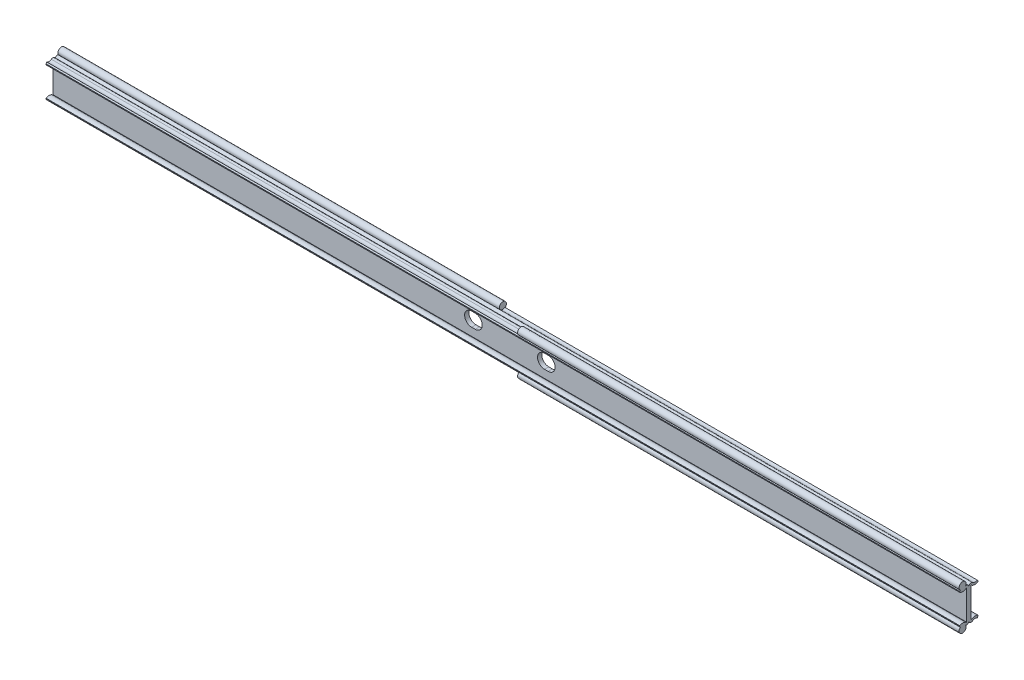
ISO-10303-21;
HEADER;
FILE_DESCRIPTION(('STEP AP214'),'2;1');
FILE_NAME('part.step','',(''),(''),'','','');
FILE_SCHEMA(('AUTOMOTIVE_DESIGN { 1 0 10303 214 1 1 1 1 }'));
ENDSEC;
DATA;
#1=APPLICATION_CONTEXT('core data for automotive mechanical design processes');
#2=APPLICATION_PROTOCOL_DEFINITION('international standard','automotive_design',2000,#1);
#3=PRODUCT_CONTEXT('',#1,'mechanical');
#4=PRODUCT('Part','Part','',(#3));
#5=PRODUCT_RELATED_PRODUCT_CATEGORY('part','',(#4));
#6=PRODUCT_DEFINITION_FORMATION('','',#4);
#7=PRODUCT_DEFINITION_CONTEXT('part definition',#1,'design');
#8=PRODUCT_DEFINITION('design','',#6,#7);
#9=PRODUCT_DEFINITION_SHAPE('','',#8);
#10=(LENGTH_UNIT() NAMED_UNIT(*) SI_UNIT(.MILLI.,.METRE.));
#11=(NAMED_UNIT(*) PLANE_ANGLE_UNIT() SI_UNIT($,.RADIAN.));
#12=(NAMED_UNIT(*) SI_UNIT($,.STERADIAN.) SOLID_ANGLE_UNIT());
#13=UNCERTAINTY_MEASURE_WITH_UNIT(LENGTH_MEASURE(1.E-05),#10,'distance_accuracy_value','');
#14=(GEOMETRIC_REPRESENTATION_CONTEXT(3) GLOBAL_UNCERTAINTY_ASSIGNED_CONTEXT((#13)) GLOBAL_UNIT_ASSIGNED_CONTEXT((#10,
#11,#12)) REPRESENTATION_CONTEXT('',''));
#15=CARTESIAN_POINT('',(0.,0.,0.));
#16=DIRECTION('',(0.,0.,1.));
#17=DIRECTION('',(1.,0.,0.));
#18=AXIS2_PLACEMENT_3D('',#15,#16,#17);
#19=CARTESIAN_POINT('',(-330.2,13.9149993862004,4.44999974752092));
#20=DIRECTION('',(1.,0.,0.));
#21=DIRECTION('',(0.,0.,-1.));
#22=AXIS2_PLACEMENT_3D('',#19,#20,#21);
#23=CYLINDRICAL_SURFACE('',#22,2.54999999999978);
#24=CARTESIAN_POINT('',(11.15,13.9149993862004,4.44999974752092));
#25=DIRECTION('',(1.,0.,0.));
#26=DIRECTION('',(0.,0.,-1.));
#27=AXIS2_PLACEMENT_3D('',#24,#25,#26);
#28=CIRCLE('',#27,2.54999999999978);
#29=CARTESIAN_POINT('',(11.15,12.0059660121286,2.75941062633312));
#30=VERTEX_POINT('',#29);
#31=CARTESIAN_POINT('',(11.15,11.8784793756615,5.98462877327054));
#32=VERTEX_POINT('',#31);
#33=EDGE_CURVE('E323',#30,#32,#28,.F.);
#34=ORIENTED_EDGE('',*,*,#33,.F.);
#35=DIRECTION('',(1.,0.,0.));
#36=VECTOR('',#35,1.);
#37=CARTESIAN_POINT('',(-330.2,12.0059660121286,2.75941062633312));
#38=LINE('',#37,#36);
#39=CARTESIAN_POINT('',(-330.2,12.0059660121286,2.75941062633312));
#40=VERTEX_POINT('',#39);
#41=EDGE_CURVE('E548',#40,#30,#38,.T.);
#42=ORIENTED_EDGE('',*,*,#41,.F.);
#43=CARTESIAN_POINT('',(-330.2,13.9149993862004,4.44999974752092));
#44=DIRECTION('',(1.,0.,0.));
#45=DIRECTION('',(0.,0.,1.));
#46=AXIS2_PLACEMENT_3D('',#43,#44,#45);
#47=CIRCLE('',#46,2.54999999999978);
#48=CARTESIAN_POINT('',(-330.2,11.8784793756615,5.98462877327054));
#49=VERTEX_POINT('',#48);
#50=EDGE_CURVE('E504',#49,#40,#47,.T.);
#51=ORIENTED_EDGE('',*,*,#50,.F.);
#52=DIRECTION('',(1.,0.,0.));
#53=VECTOR('',#52,1.);
#54=CARTESIAN_POINT('',(-330.2,11.8784793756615,5.98462877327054));
#55=LINE('',#54,#53);
#56=EDGE_CURVE('E551',#49,#32,#55,.T.);
#57=ORIENTED_EDGE('',*,*,#56,.T.);
#58=EDGE_LOOP('',(#34,#42,#51,#57));
#59=FACE_BOUND('',#58,.T.);
#60=ADVANCED_FACE('F14',(#59),#23,.F.);
#61=CARTESIAN_POINT('',(-330.2,13.9149993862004,-4.44999974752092));
#62=DIRECTION('',(1.,0.,0.));
#63=DIRECTION('',(0.,0.,-1.));
#64=AXIS2_PLACEMENT_3D('',#61,#62,#63);
#65=CYLINDRICAL_SURFACE('',#64,2.54999999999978);
#66=CARTESIAN_POINT('',(-11.15,13.9149993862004,-4.44999974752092));
#67=DIRECTION('',(-1.,0.,0.));
#68=DIRECTION('',(0.,0.,1.));
#69=AXIS2_PLACEMENT_3D('',#66,#67,#68);
#70=CIRCLE('',#69,2.54999999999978);
#71=CARTESIAN_POINT('',(-11.15,12.0059660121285,-2.75941062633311));
#72=VERTEX_POINT('',#71);
#73=CARTESIAN_POINT('',(-11.15,11.8784793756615,-5.98462877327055));
#74=VERTEX_POINT('',#73);
#75=EDGE_CURVE('E357',#72,#74,#70,.F.);
#76=ORIENTED_EDGE('',*,*,#75,.F.);
#77=DIRECTION('',(1.,0.,0.));
#78=VECTOR('',#77,1.);
#79=CARTESIAN_POINT('',(-330.2,12.0059660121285,-2.75941062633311));
#80=LINE('',#79,#78);
#81=CARTESIAN_POINT('',(330.2,12.0059660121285,-2.75941062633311));
#82=VERTEX_POINT('',#81);
#83=EDGE_CURVE('E543',#72,#82,#80,.T.);
#84=ORIENTED_EDGE('',*,*,#83,.T.);
#85=CARTESIAN_POINT('',(330.2,13.9149993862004,-4.44999974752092));
#86=DIRECTION('',(1.,0.,0.));
#87=DIRECTION('',(0.,0.,-1.));
#88=AXIS2_PLACEMENT_3D('',#85,#86,#87);
#89=CIRCLE('',#88,2.54999999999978);
#90=CARTESIAN_POINT('',(330.2,11.8784793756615,-5.98462877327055));
#91=VERTEX_POINT('',#90);
#92=EDGE_CURVE('E457',#82,#91,#89,.T.);
#93=ORIENTED_EDGE('',*,*,#92,.T.);
#94=DIRECTION('',(1.,0.,0.));
#95=VECTOR('',#94,1.);
#96=CARTESIAN_POINT('',(-330.2,11.8784793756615,-5.98462877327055));
#97=LINE('',#96,#95);
#98=EDGE_CURVE('E541',#74,#91,#97,.T.);
#99=ORIENTED_EDGE('',*,*,#98,.F.);
#100=EDGE_LOOP('',(#76,#84,#93,#99));
#101=FACE_BOUND('',#100,.T.);
#102=ADVANCED_FACE('F682',(#101),#65,.F.);
#103=CARTESIAN_POINT('',(-330.2,-13.9149993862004,-4.44999974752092));
#104=DIRECTION('',(1.,0.,0.));
#105=DIRECTION('',(0.,0.,-1.));
#106=AXIS2_PLACEMENT_3D('',#103,#104,#105);
#107=CYLINDRICAL_SURFACE('',#106,4.09999984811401);
#108=CARTESIAN_POINT('',(330.2,-13.9149993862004,-4.44999974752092));
#109=DIRECTION('',(-1.,0.,0.));
#110=DIRECTION('',(0.,0.,-1.));
#111=AXIS2_PLACEMENT_3D('',#108,#109,#110);
#112=CIRCLE('',#111,4.09999984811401);
#113=CARTESIAN_POINT('',(330.2,-10.8444021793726,-1.73312073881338));
#114=VERTEX_POINT('',#113);
#115=CARTESIAN_POINT('',(330.2,-10.4239395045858,-6.59999966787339));
#116=VERTEX_POINT('',#115);
#117=EDGE_CURVE('E423',#114,#116,#112,.T.);
#118=ORIENTED_EDGE('',*,*,#117,.T.);
#119=DIRECTION('',(1.,0.,0.));
#120=VECTOR('',#119,1.);
#121=CARTESIAN_POINT('',(-330.2,-10.4239395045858,-6.59999966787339));
#122=LINE('',#121,#120);
#123=CARTESIAN_POINT('',(-330.2,-10.4239395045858,-6.59999966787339));
#124=VERTEX_POINT('',#123);
#125=EDGE_CURVE('E591',#124,#116,#122,.T.);
#126=ORIENTED_EDGE('',*,*,#125,.F.);
#127=CARTESIAN_POINT('',(-330.2,-13.9149993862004,-4.44999974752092));
#128=DIRECTION('',(-1.,0.,0.));
#129=DIRECTION('',(0.,0.,-1.));
#130=AXIS2_PLACEMENT_3D('',#127,#128,#129);
#131=CIRCLE('',#130,4.09999984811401);
#132=CARTESIAN_POINT('',(-330.2,-10.8444021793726,-1.73312073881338));
#133=VERTEX_POINT('',#132);
#134=EDGE_CURVE('E472',#133,#124,#131,.T.);
#135=ORIENTED_EDGE('',*,*,#134,.F.);
#136=DIRECTION('',(1.,0.,0.));
#137=VECTOR('',#136,1.);
#138=CARTESIAN_POINT('',(-330.2,-10.8444021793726,-1.73312073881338));
#139=LINE('',#138,#137);
#140=EDGE_CURVE('E523',#133,#114,#139,.T.);
#141=ORIENTED_EDGE('',*,*,#140,.T.);
#142=EDGE_LOOP('',(#118,#126,#135,#141));
#143=FACE_BOUND('',#142,.T.);
#144=ADVANCED_FACE('F16',(#143),#107,.T.);
#145=CARTESIAN_POINT('',(-330.2,-11.0618535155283,-6.59999966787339));
#146=DIRECTION('',(0.,0.,1.));
#147=DIRECTION('',(1.,0.,0.));
#148=AXIS2_PLACEMENT_3D('',#145,#146,#147);
#149=PLANE('',#148);
#150=DIRECTION('',(0.,-1.,0.));
#151=VECTOR('',#150,1.);
#152=CARTESIAN_POINT('',(330.2,-11.0618535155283,-6.59999966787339));
#153=LINE('',#152,#151);
#154=CARTESIAN_POINT('',(330.2,-11.0618535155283,-6.59999966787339));
#155=VERTEX_POINT('',#154);
#156=EDGE_CURVE('E426',#116,#155,#153,.T.);
#157=ORIENTED_EDGE('',*,*,#156,.T.);
#158=DIRECTION('',(1.,0.,0.));
#159=VECTOR('',#158,1.);
#160=CARTESIAN_POINT('',(-330.2,-11.0618535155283,-6.59999966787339));
#161=LINE('',#160,#159);
#162=CARTESIAN_POINT('',(-330.2,-11.0618535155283,-6.59999966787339));
#163=VERTEX_POINT('',#162);
#164=EDGE_CURVE('E588',#163,#155,#161,.T.);
#165=ORIENTED_EDGE('',*,*,#164,.F.);
#166=DIRECTION('',(0.,-1.,0.));
#167=VECTOR('',#166,1.);
#168=CARTESIAN_POINT('',(-330.2,-11.0618535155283,-6.59999966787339));
#169=LINE('',#168,#167);
#170=EDGE_CURVE('E475',#124,#163,#169,.T.);
#171=ORIENTED_EDGE('',*,*,#170,.F.);
#172=ORIENTED_EDGE('',*,*,#125,.T.);
#173=EDGE_LOOP('',(#157,#165,#171,#172));
#174=FACE_BOUND('',#173,.T.);
#175=ADVANCED_FACE('F727',(#174),#149,.F.);
#176=CARTESIAN_POINT('',(-330.2,-11.8784793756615,-5.98462877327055));
#177=DIRECTION('',(0.,0.601814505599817,0.79863590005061));
#178=DIRECTION('',(0.,0.79863590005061,-0.601814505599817));
#179=AXIS2_PLACEMENT_3D('',#176,#177,#178);
#180=PLANE('',#179);
#181=DIRECTION('',(0.,0.79863590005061,-0.601814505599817));
#182=VECTOR('',#181,1.);
#183=CARTESIAN_POINT('',(-11.15,-11.8784793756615,-5.98462877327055));
#184=LINE('',#183,#182);
#185=CARTESIAN_POINT('',(-11.15,-11.8784793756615,-5.98462877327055));
#186=VERTEX_POINT('',#185);
#187=CARTESIAN_POINT('',(-11.15,-11.6159967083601,-6.18242338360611));
#188=VERTEX_POINT('',#187);
#189=EDGE_CURVE('E343',#186,#188,#184,.T.);
#190=ORIENTED_EDGE('',*,*,#189,.T.);
#191=DIRECTION('',(-1.,0.,0.));
#192=VECTOR('',#191,1.);
#193=CARTESIAN_POINT('',(-11.15,-11.6159967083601,-6.18242338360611));
#194=LINE('',#193,#192);
#195=CARTESIAN_POINT('',(-330.2,-11.6159967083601,-6.18242338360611));
#196=VERTEX_POINT('',#195);
#197=EDGE_CURVE('E337',#188,#196,#194,.T.);
#198=ORIENTED_EDGE('',*,*,#197,.T.);
#199=DIRECTION('',(0.,-0.79863590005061,0.601814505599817));
#200=VECTOR('',#199,1.);
#201=CARTESIAN_POINT('',(-330.2,-11.8784793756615,-5.98462877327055));
#202=LINE('',#201,#200);
#203=EDGE_CURVE('E477',#163,#196,#202,.T.);
#204=ORIENTED_EDGE('',*,*,#203,.F.);
#205=ORIENTED_EDGE('',*,*,#164,.T.);
#206=DIRECTION('',(0.,-0.79863590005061,0.601814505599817));
#207=VECTOR('',#206,1.);
#208=CARTESIAN_POINT('',(330.2,-11.8784793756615,-5.98462877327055));
#209=LINE('',#208,#207);
#210=CARTESIAN_POINT('',(330.2,-11.8784793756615,-5.98462877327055));
#211=VERTEX_POINT('',#210);
#212=EDGE_CURVE('E428',#155,#211,#209,.T.);
#213=ORIENTED_EDGE('',*,*,#212,.T.);
#214=DIRECTION('',(1.,0.,0.));
#215=VECTOR('',#214,1.);
#216=CARTESIAN_POINT('',(-330.2,-11.8784793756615,-5.98462877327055));
#217=LINE('',#216,#215);
#218=EDGE_CURVE('E586',#186,#211,#217,.T.);
#219=ORIENTED_EDGE('',*,*,#218,.F.);
#220=EDGE_LOOP('',(#190,#198,#204,#205,#213,#219));
#221=FACE_BOUND('',#220,.T.);
#222=ADVANCED_FACE('F724',(#221),#180,.F.);
#223=CARTESIAN_POINT('',(-330.2,-13.9149993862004,-4.44999974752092));
#224=DIRECTION('',(1.,0.,0.));
#225=DIRECTION('',(0.,0.,-1.));
#226=AXIS2_PLACEMENT_3D('',#223,#224,#225);
#227=CYLINDRICAL_SURFACE('',#226,2.54999999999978);
#228=DIRECTION('',(1.,0.,0.));
#229=VECTOR('',#228,1.);
#230=CARTESIAN_POINT('',(-330.2,-12.0059660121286,-2.75941062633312));
#231=LINE('',#230,#229);
#232=CARTESIAN_POINT('',(-11.15,-12.0059660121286,-2.75941062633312));
#233=VERTEX_POINT('',#232);
#234=CARTESIAN_POINT('',(330.2,-12.0059660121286,-2.75941062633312));
#235=VERTEX_POINT('',#234);
#236=EDGE_CURVE('E584',#233,#235,#231,.T.);
#237=ORIENTED_EDGE('',*,*,#236,.F.);
#238=CARTESIAN_POINT('',(-11.15,-13.9149993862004,-4.44999974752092));
#239=DIRECTION('',(1.,0.,0.));
#240=DIRECTION('',(0.,0.,-1.));
#241=AXIS2_PLACEMENT_3D('',#238,#239,#240);
#242=CIRCLE('',#241,2.54999999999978);
#243=EDGE_CURVE('E340',#233,#186,#242,.F.);
#244=ORIENTED_EDGE('',*,*,#243,.T.);
#245=ORIENTED_EDGE('',*,*,#218,.T.);
#246=CARTESIAN_POINT('',(330.2,-13.9149993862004,-4.44999974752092));
#247=DIRECTION('',(1.,0.,0.));
#248=DIRECTION('',(0.,0.,1.));
#249=AXIS2_PLACEMENT_3D('',#246,#247,#248);
#250=CIRCLE('',#249,2.54999999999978);
#251=EDGE_CURVE('E431',#211,#235,#250,.T.);
#252=ORIENTED_EDGE('',*,*,#251,.T.);
#253=EDGE_LOOP('',(#237,#244,#245,#252));
#254=FACE_BOUND('',#253,.T.);
#255=ADVANCED_FACE('F720',(#254),#227,.F.);
#256=CARTESIAN_POINT('',(-330.2,-10.7622235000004,-1.65999984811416));
#257=DIRECTION('',(1.,0.,0.));
#258=DIRECTION('',(0.,0.,-1.));
#259=AXIS2_PLACEMENT_3D('',#256,#257,#258);
#260=CYLINDRICAL_SURFACE('',#259,1.65999984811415);
#261=CARTESIAN_POINT('',(-330.2,-10.7622235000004,-1.65999984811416));
#262=DIRECTION('',(-1.,0.,0.));
#263=DIRECTION('',(0.,0.,-1.));
#264=AXIS2_PLACEMENT_3D('',#261,#262,#263);
#265=CIRCLE('',#264,1.65999984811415);
#266=CARTESIAN_POINT('',(-330.2,-12.2669165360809,-2.36106929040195));
#267=VERTEX_POINT('',#266);
#268=CARTESIAN_POINT('',(-330.2,-10.7622235,0.));
#269=VERTEX_POINT('',#268);
#270=EDGE_CURVE('E480',#267,#269,#265,.T.);
#271=ORIENTED_EDGE('',*,*,#270,.F.);
#272=DIRECTION('',(-1.,0.,0.));
#273=VECTOR('',#272,1.);
#274=CARTESIAN_POINT('',(-170.675,-12.2669165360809,-2.36106929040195));
#275=LINE('',#274,#273);
#276=CARTESIAN_POINT('',(-11.15,-12.2669165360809,-2.36106929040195));
#277=VERTEX_POINT('',#276);
#278=EDGE_CURVE('E333',#267,#277,#275,.F.);
#279=ORIENTED_EDGE('',*,*,#278,.T.);
#280=CARTESIAN_POINT('',(-11.15,-10.7622235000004,-1.65999984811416));
#281=DIRECTION('',(1.,0.,0.));
#282=DIRECTION('',(0.,0.,-1.));
#283=AXIS2_PLACEMENT_3D('',#280,#281,#282);
#284=CIRCLE('',#283,1.65999984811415);
#285=EDGE_CURVE('E596',#277,#233,#284,.T.);
#286=ORIENTED_EDGE('',*,*,#285,.T.);
#287=ORIENTED_EDGE('',*,*,#236,.T.);
#288=CARTESIAN_POINT('',(330.2,-10.7622235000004,-1.65999984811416));
#289=DIRECTION('',(-1.,0.,0.));
#290=DIRECTION('',(0.,0.,-1.));
#291=AXIS2_PLACEMENT_3D('',#288,#289,#290);
#292=CIRCLE('',#291,1.65999984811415);
#293=CARTESIAN_POINT('',(330.2,-10.7622235,0.));
#294=VERTEX_POINT('',#293);
#295=EDGE_CURVE('E434',#235,#294,#292,.T.);
#296=ORIENTED_EDGE('',*,*,#295,.T.);
#297=DIRECTION('',(1.,0.,0.));
#298=VECTOR('',#297,1.);
#299=CARTESIAN_POINT('',(-330.2,-10.7622235,0.));
#300=LINE('',#299,#298);
#301=EDGE_CURVE('E581',#269,#294,#300,.T.);
#302=ORIENTED_EDGE('',*,*,#301,.F.);
#303=EDGE_LOOP('',(#271,#279,#286,#287,#296,#302));
#304=FACE_BOUND('',#303,.T.);
#305=ADVANCED_FACE('F717',(#304),#260,.T.);
#306=CARTESIAN_POINT('',(-330.2,-10.7622235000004,1.65999984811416));
#307=DIRECTION('',(1.,0.,0.));
#308=DIRECTION('',(0.,0.,-1.));
#309=AXIS2_PLACEMENT_3D('',#306,#307,#308);
#310=CYLINDRICAL_SURFACE('',#309,1.65999984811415);
#311=CARTESIAN_POINT('',(330.2,-10.7622235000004,1.65999984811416));
#312=DIRECTION('',(-1.,0.,0.));
#313=DIRECTION('',(0.,0.,1.));
#314=AXIS2_PLACEMENT_3D('',#311,#312,#313);
#315=CIRCLE('',#314,1.65999984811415);
#316=CARTESIAN_POINT('',(330.2,-12.2669165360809,2.36106929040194));
#317=VERTEX_POINT('',#316);
#318=EDGE_CURVE('E292',#294,#317,#315,.T.);
#319=ORIENTED_EDGE('',*,*,#318,.T.);
#320=DIRECTION('',(1.,0.,0.));
#321=VECTOR('',#320,1.);
#322=CARTESIAN_POINT('',(170.675,-12.2669165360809,2.36106929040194));
#323=LINE('',#322,#321);
#324=CARTESIAN_POINT('',(11.15,-12.2669165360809,2.36106929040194));
#325=VERTEX_POINT('',#324);
#326=EDGE_CURVE('E29',#317,#325,#323,.F.);
#327=ORIENTED_EDGE('',*,*,#326,.T.);
#328=CARTESIAN_POINT('',(11.15,-10.7622235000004,1.65999984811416));
#329=DIRECTION('',(-1.,0.,0.));
#330=DIRECTION('',(0.,0.,1.));
#331=AXIS2_PLACEMENT_3D('',#328,#329,#330);
#332=CIRCLE('',#331,1.65999984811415);
#333=CARTESIAN_POINT('',(11.15,-12.0059660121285,2.75941062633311));
#334=VERTEX_POINT('',#333);
#335=EDGE_CURVE('E33',#325,#334,#332,.T.);
#336=ORIENTED_EDGE('',*,*,#335,.T.);
#337=DIRECTION('',(1.,0.,0.));
#338=VECTOR('',#337,1.);
#339=CARTESIAN_POINT('',(-330.2,-12.0059660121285,2.75941062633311));
#340=LINE('',#339,#338);
#341=CARTESIAN_POINT('',(-330.2,-12.0059660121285,2.75941062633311));
#342=VERTEX_POINT('',#341);
#343=EDGE_CURVE('E579',#342,#334,#340,.T.);
#344=ORIENTED_EDGE('',*,*,#343,.F.);
#345=CARTESIAN_POINT('',(-330.2,-10.7622235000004,1.65999984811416));
#346=DIRECTION('',(-1.,0.,0.));
#347=DIRECTION('',(0.,0.,1.));
#348=AXIS2_PLACEMENT_3D('',#345,#346,#347);
#349=CIRCLE('',#348,1.65999984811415);
#350=EDGE_CURVE('E482',#269,#342,#349,.T.);
#351=ORIENTED_EDGE('',*,*,#350,.F.);
#352=ORIENTED_EDGE('',*,*,#301,.T.);
#353=EDGE_LOOP('',(#319,#327,#336,#344,#351,#352));
#354=FACE_BOUND('',#353,.T.);
#355=ADVANCED_FACE('F714',(#354),#310,.T.);
#356=CARTESIAN_POINT('',(-330.2,-13.9149993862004,4.44999974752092));
#357=DIRECTION('',(1.,0.,0.));
#358=DIRECTION('',(0.,0.,-1.));
#359=AXIS2_PLACEMENT_3D('',#356,#357,#358);
#360=CYLINDRICAL_SURFACE('',#359,2.54999999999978);
#361=ORIENTED_EDGE('',*,*,#343,.T.);
#362=CARTESIAN_POINT('',(11.15,-13.9149993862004,4.44999974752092));
#363=DIRECTION('',(-1.,0.,0.));
#364=DIRECTION('',(0.,0.,1.));
#365=AXIS2_PLACEMENT_3D('',#362,#363,#364);
#366=CIRCLE('',#365,2.54999999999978);
#367=CARTESIAN_POINT('',(11.15,-11.8784793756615,5.98462877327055));
#368=VERTEX_POINT('',#367);
#369=EDGE_CURVE('E309',#334,#368,#366,.F.);
#370=ORIENTED_EDGE('',*,*,#369,.T.);
#371=DIRECTION('',(1.,0.,0.));
#372=VECTOR('',#371,1.);
#373=CARTESIAN_POINT('',(-330.2,-11.8784793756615,5.98462877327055));
#374=LINE('',#373,#372);
#375=CARTESIAN_POINT('',(-330.2,-11.8784793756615,5.98462877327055));
#376=VERTEX_POINT('',#375);
#377=EDGE_CURVE('E577',#376,#368,#374,.T.);
#378=ORIENTED_EDGE('',*,*,#377,.F.);
#379=CARTESIAN_POINT('',(-330.2,-13.9149993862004,4.44999974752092));
#380=DIRECTION('',(1.,0.,0.));
#381=DIRECTION('',(0.,0.,-1.));
#382=AXIS2_PLACEMENT_3D('',#379,#380,#381);
#383=CIRCLE('',#382,2.54999999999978);
#384=EDGE_CURVE('E484',#342,#376,#383,.T.);
#385=ORIENTED_EDGE('',*,*,#384,.F.);
#386=EDGE_LOOP('',(#361,#370,#378,#385));
#387=FACE_BOUND('',#386,.T.);
#388=ADVANCED_FACE('F667',(#387),#360,.F.);
#389=CARTESIAN_POINT('',(-330.2,-11.8784793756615,5.98462877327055));
#390=DIRECTION('',(0.,0.601814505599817,-0.79863590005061));
#391=DIRECTION('',(0.,-0.79863590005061,-0.601814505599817));
#392=AXIS2_PLACEMENT_3D('',#389,#390,#391);
#393=PLANE('',#392);
#394=DIRECTION('',(0.,0.79863590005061,0.601814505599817));
#395=VECTOR('',#394,1.);
#396=CARTESIAN_POINT('',(11.15,-11.8784793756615,5.98462877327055));
#397=LINE('',#396,#395);
#398=CARTESIAN_POINT('',(11.15,-11.6159967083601,6.18242338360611));
#399=VERTEX_POINT('',#398);
#400=EDGE_CURVE('E9',#368,#399,#397,.T.);
#401=ORIENTED_EDGE('',*,*,#400,.T.);
#402=DIRECTION('',(1.,0.,0.));
#403=VECTOR('',#402,1.);
#404=CARTESIAN_POINT('',(11.15,-11.6159967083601,6.18242338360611));
#405=LINE('',#404,#403);
#406=CARTESIAN_POINT('',(330.2,-11.6159967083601,6.18242338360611));
#407=VERTEX_POINT('',#406);
#408=EDGE_CURVE('E295',#399,#407,#405,.T.);
#409=ORIENTED_EDGE('',*,*,#408,.T.);
#410=DIRECTION('',(0.,0.79863590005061,0.601814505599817));
#411=VECTOR('',#410,1.);
#412=CARTESIAN_POINT('',(330.2,-11.8784793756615,5.98462877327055));
#413=LINE('',#412,#411);
#414=CARTESIAN_POINT('',(330.2,-11.0618535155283,6.59999966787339));
#415=VERTEX_POINT('',#414);
#416=EDGE_CURVE('E281',#407,#415,#413,.T.);
#417=ORIENTED_EDGE('',*,*,#416,.T.);
#418=DIRECTION('',(1.,0.,0.));
#419=VECTOR('',#418,1.);
#420=CARTESIAN_POINT('',(-330.2,-11.0618535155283,6.59999966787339));
#421=LINE('',#420,#419);
#422=CARTESIAN_POINT('',(-330.2,-11.0618535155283,6.59999966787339));
#423=VERTEX_POINT('',#422);
#424=EDGE_CURVE('E575',#423,#415,#421,.T.);
#425=ORIENTED_EDGE('',*,*,#424,.F.);
#426=DIRECTION('',(0.,0.79863590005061,0.601814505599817));
#427=VECTOR('',#426,1.);
#428=CARTESIAN_POINT('',(-330.2,-11.8784793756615,5.98462877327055));
#429=LINE('',#428,#427);
#430=EDGE_CURVE('E486',#376,#423,#429,.T.);
#431=ORIENTED_EDGE('',*,*,#430,.F.);
#432=ORIENTED_EDGE('',*,*,#377,.T.);
#433=EDGE_LOOP('',(#401,#409,#417,#425,#431,#432));
#434=FACE_BOUND('',#433,.T.);
#435=ADVANCED_FACE('F296',(#434),#393,.F.);
#436=CARTESIAN_POINT('',(-330.2,-11.0618535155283,6.59999966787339));
#437=DIRECTION('',(0.,0.,-1.));
#438=DIRECTION('',(-1.,0.,0.));
#439=AXIS2_PLACEMENT_3D('',#436,#437,#438);
#440=PLANE('',#439);
#441=DIRECTION('',(0.,1.,0.));
#442=VECTOR('',#441,1.);
#443=CARTESIAN_POINT('',(330.2,-11.0618535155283,6.59999966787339));
#444=LINE('',#443,#442);
#445=CARTESIAN_POINT('',(330.2,-10.4239395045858,6.59999966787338));
#446=VERTEX_POINT('',#445);
#447=EDGE_CURVE('E288',#415,#446,#444,.T.);
#448=ORIENTED_EDGE('',*,*,#447,.T.);
#449=DIRECTION('',(1.,0.,0.));
#450=VECTOR('',#449,1.);
#451=CARTESIAN_POINT('',(-330.2,-10.4239395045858,6.59999966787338));
#452=LINE('',#451,#450);
#453=CARTESIAN_POINT('',(-330.2,-10.4239395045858,6.59999966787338));
#454=VERTEX_POINT('',#453);
#455=EDGE_CURVE('E572',#454,#446,#452,.T.);
#456=ORIENTED_EDGE('',*,*,#455,.F.);
#457=DIRECTION('',(0.,1.,0.));
#458=VECTOR('',#457,1.);
#459=CARTESIAN_POINT('',(-330.2,-11.0618535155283,6.59999966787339));
#460=LINE('',#459,#458);
#461=EDGE_CURVE('E488',#423,#454,#460,.T.);
#462=ORIENTED_EDGE('',*,*,#461,.F.);
#463=ORIENTED_EDGE('',*,*,#424,.T.);
#464=EDGE_LOOP('',(#448,#456,#462,#463));
#465=FACE_BOUND('',#464,.T.);
#466=ADVANCED_FACE('F661',(#465),#440,.F.);
#467=CARTESIAN_POINT('',(-330.2,-13.9149993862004,4.44999974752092));
#468=DIRECTION('',(1.,0.,0.));
#469=DIRECTION('',(0.,0.,-1.));
#470=AXIS2_PLACEMENT_3D('',#467,#468,#469);
#471=CYLINDRICAL_SURFACE('',#470,4.09999984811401);
#472=CARTESIAN_POINT('',(330.2,-13.9149993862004,4.44999974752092));
#473=DIRECTION('',(-1.,0.,0.));
#474=DIRECTION('',(0.,0.,1.));
#475=AXIS2_PLACEMENT_3D('',#472,#473,#474);
#476=CIRCLE('',#475,4.09999984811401);
#477=CARTESIAN_POINT('',(330.2,-10.8444021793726,1.73312073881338));
#478=VERTEX_POINT('',#477);
#479=EDGE_CURVE('E438',#446,#478,#476,.T.);
#480=ORIENTED_EDGE('',*,*,#479,.T.);
#481=DIRECTION('',(1.,0.,0.));
#482=VECTOR('',#481,1.);
#483=CARTESIAN_POINT('',(-330.2,-10.8444021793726,1.73312073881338));
#484=LINE('',#483,#482);
#485=CARTESIAN_POINT('',(-330.2,-10.8444021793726,1.73312073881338));
#486=VERTEX_POINT('',#485);
#487=EDGE_CURVE('E569',#486,#478,#484,.T.);
#488=ORIENTED_EDGE('',*,*,#487,.F.);
#489=CARTESIAN_POINT('',(-330.2,-13.9149993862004,4.44999974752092));
#490=DIRECTION('',(-1.,0.,0.));
#491=DIRECTION('',(0.,0.,1.));
#492=AXIS2_PLACEMENT_3D('',#489,#490,#491);
#493=CIRCLE('',#492,4.09999984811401);
#494=EDGE_CURVE('E490',#454,#486,#493,.T.);
#495=ORIENTED_EDGE('',*,*,#494,.F.);
#496=ORIENTED_EDGE('',*,*,#455,.T.);
#497=EDGE_LOOP('',(#480,#488,#495,#496));
#498=FACE_BOUND('',#497,.T.);
#499=ADVANCED_FACE('F657',(#498),#471,.T.);
#500=CARTESIAN_POINT('',(-330.2,-10.7622235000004,1.65999984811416));
#501=DIRECTION('',(1.,0.,0.));
#502=DIRECTION('',(0.,0.,-1.));
#503=AXIS2_PLACEMENT_3D('',#500,#501,#502);
#504=CYLINDRICAL_SURFACE('',#503,0.110000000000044);
#505=CARTESIAN_POINT('',(330.2,-10.7622235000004,1.65999984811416));
#506=DIRECTION('',(1.,0.,0.));
#507=DIRECTION('',(0.,0.,-1.));
#508=AXIS2_PLACEMENT_3D('',#505,#506,#507);
#509=CIRCLE('',#508,0.110000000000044);
#510=CARTESIAN_POINT('',(330.2,-10.7622235,1.5499998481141));
#511=VERTEX_POINT('',#510);
#512=EDGE_CURVE('E440',#478,#511,#509,.T.);
#513=ORIENTED_EDGE('',*,*,#512,.T.);
#514=DIRECTION('',(1.,0.,0.));
#515=VECTOR('',#514,1.);
#516=CARTESIAN_POINT('',(-330.2,-10.7622235,1.5499998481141));
#517=LINE('',#516,#515);
#518=CARTESIAN_POINT('',(-330.2,-10.7622235,1.5499998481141));
#519=VERTEX_POINT('',#518);
#520=EDGE_CURVE('E566',#519,#511,#517,.T.);
#521=ORIENTED_EDGE('',*,*,#520,.F.);
#522=CARTESIAN_POINT('',(-330.2,-10.7622235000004,1.65999984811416));
#523=DIRECTION('',(1.,0.,0.));
#524=DIRECTION('',(0.,0.,-1.));
#525=AXIS2_PLACEMENT_3D('',#522,#523,#524);
#526=CIRCLE('',#525,0.110000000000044);
#527=EDGE_CURVE('E492',#486,#519,#526,.T.);
#528=ORIENTED_EDGE('',*,*,#527,.F.);
#529=ORIENTED_EDGE('',*,*,#487,.T.);
#530=EDGE_LOOP('',(#513,#521,#528,#529));
#531=FACE_BOUND('',#530,.T.);
#532=ADVANCED_FACE('F652',(#531),#504,.F.);
#533=CARTESIAN_POINT('',(-330.2,10.7622235,1.5499998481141));
#534=DIRECTION('',(0.,0.,-1.));
#535=DIRECTION('',(-1.,0.,0.));
#536=AXIS2_PLACEMENT_3D('',#533,#534,#535);
#537=PLANE('',#536);
#538=DIRECTION('',(1.,0.,0.));
#539=VECTOR('',#538,1.);
#540=CARTESIAN_POINT('',(27.65,-5.05,1.5499998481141));
#541=LINE('',#540,#539);
#542=CARTESIAN_POINT('',(25.05,-5.05,1.5499998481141));
#543=VERTEX_POINT('',#542);
#544=CARTESIAN_POINT('',(27.65,-5.05,1.5499998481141));
#545=VERTEX_POINT('',#544);
#546=EDGE_CURVE('E371',#543,#545,#541,.T.);
#547=ORIENTED_EDGE('',*,*,#546,.F.);
#548=CARTESIAN_POINT('',(25.05,0.,1.5499998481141));
#549=DIRECTION('',(0.,0.,1.));
#550=DIRECTION('',(1.,0.,0.));
#551=AXIS2_PLACEMENT_3D('',#548,#549,#550);
#552=CIRCLE('',#551,5.05);
#553=CARTESIAN_POINT('',(25.05,5.05,1.5499998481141));
#554=VERTEX_POINT('',#553);
#555=EDGE_CURVE('E369',#554,#543,#552,.T.);
#556=ORIENTED_EDGE('',*,*,#555,.F.);
#557=DIRECTION('',(-1.,0.,0.));
#558=VECTOR('',#557,1.);
#559=CARTESIAN_POINT('',(25.05,5.05,1.5499998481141));
#560=LINE('',#559,#558);
#561=CARTESIAN_POINT('',(27.65,5.05,1.5499998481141));
#562=VERTEX_POINT('',#561);
#563=EDGE_CURVE('E377',#562,#554,#560,.T.);
#564=ORIENTED_EDGE('',*,*,#563,.F.);
#565=CARTESIAN_POINT('',(27.65,0.,1.5499998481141));
#566=DIRECTION('',(0.,0.,1.));
#567=DIRECTION('',(1.,0.,0.));
#568=AXIS2_PLACEMENT_3D('',#565,#566,#567);
#569=CIRCLE('',#568,5.05);
#570=EDGE_CURVE('E374',#545,#562,#569,.T.);
#571=ORIENTED_EDGE('',*,*,#570,.F.);
#572=EDGE_LOOP('',(#547,#556,#564,#571));
#573=FACE_BOUND('',#572,.T.);
#574=DIRECTION('',(1.,0.,0.));
#575=VECTOR('',#574,1.);
#576=CARTESIAN_POINT('',(-27.65,-5.05,1.5499998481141));
#577=LINE('',#576,#575);
#578=CARTESIAN_POINT('',(-27.65,-5.05,1.5499998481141));
#579=VERTEX_POINT('',#578);
#580=CARTESIAN_POINT('',(-25.05,-5.05,1.5499998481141));
#581=VERTEX_POINT('',#580);
#582=EDGE_CURVE('E402',#579,#581,#577,.T.);
#583=ORIENTED_EDGE('',*,*,#582,.F.);
#584=CARTESIAN_POINT('',(-27.65,0.,1.5499998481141));
#585=DIRECTION('',(0.,0.,1.));
#586=DIRECTION('',(-1.,0.,0.));
#587=AXIS2_PLACEMENT_3D('',#584,#585,#586);
#588=CIRCLE('',#587,5.05);
#589=CARTESIAN_POINT('',(-27.65,5.05,1.5499998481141));
#590=VERTEX_POINT('',#589);
#591=EDGE_CURVE('E400',#590,#579,#588,.T.);
#592=ORIENTED_EDGE('',*,*,#591,.F.);
#593=DIRECTION('',(-1.,0.,0.));
#594=VECTOR('',#593,1.);
#595=CARTESIAN_POINT('',(-25.05,5.05,1.5499998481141));
#596=LINE('',#595,#594);
#597=CARTESIAN_POINT('',(-25.05,5.05,1.5499998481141));
#598=VERTEX_POINT('',#597);
#599=EDGE_CURVE('E408',#598,#590,#596,.T.);
#600=ORIENTED_EDGE('',*,*,#599,.F.);
#601=CARTESIAN_POINT('',(-25.05,0.,1.5499998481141));
#602=DIRECTION('',(0.,0.,1.));
#603=DIRECTION('',(-1.,0.,0.));
#604=AXIS2_PLACEMENT_3D('',#601,#602,#603);
#605=CIRCLE('',#604,5.05);
#606=EDGE_CURVE('E405',#581,#598,#605,.T.);
#607=ORIENTED_EDGE('',*,*,#606,.F.);
#608=EDGE_LOOP('',(#583,#592,#600,#607));
#609=FACE_BOUND('',#608,.T.);
#610=DIRECTION('',(0.,1.,0.));
#611=VECTOR('',#610,1.);
#612=CARTESIAN_POINT('',(330.2,10.7622235,1.5499998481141));
#613=LINE('',#612,#611);
#614=CARTESIAN_POINT('',(330.2,10.7622235,1.54999984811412));
#615=VERTEX_POINT('',#614);
#616=EDGE_CURVE('E442',#511,#615,#613,.T.);
#617=ORIENTED_EDGE('',*,*,#616,.T.);
#618=DIRECTION('',(1.,0.,0.));
#619=VECTOR('',#618,1.);
#620=CARTESIAN_POINT('',(-330.2,10.7622235,1.54999984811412));
#621=LINE('',#620,#619);
#622=CARTESIAN_POINT('',(-330.2,10.7622235,1.54999984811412));
#623=VERTEX_POINT('',#622);
#624=EDGE_CURVE('E563',#623,#615,#621,.T.);
#625=ORIENTED_EDGE('',*,*,#624,.F.);
#626=DIRECTION('',(0.,1.,0.));
#627=VECTOR('',#626,1.);
#628=CARTESIAN_POINT('',(-330.2,10.7622235,1.5499998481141));
#629=LINE('',#628,#627);
#630=EDGE_CURVE('E494',#519,#623,#629,.T.);
#631=ORIENTED_EDGE('',*,*,#630,.F.);
#632=ORIENTED_EDGE('',*,*,#520,.T.);
#633=EDGE_LOOP('',(#617,#625,#631,#632));
#634=FACE_BOUND('',#633,.T.);
#635=ADVANCED_FACE('F648',(#573,#609,#634),#537,.F.);
#636=CARTESIAN_POINT('',(-330.2,10.7622235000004,1.65999984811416));
#637=DIRECTION('',(1.,0.,0.));
#638=DIRECTION('',(0.,0.,-1.));
#639=AXIS2_PLACEMENT_3D('',#636,#637,#638);
#640=CYLINDRICAL_SURFACE('',#639,0.110000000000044);
#641=CARTESIAN_POINT('',(330.2,10.7622235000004,1.65999984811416));
#642=DIRECTION('',(1.,0.,0.));
#643=DIRECTION('',(0.,0.,1.));
#644=AXIS2_PLACEMENT_3D('',#641,#642,#643);
#645=CIRCLE('',#644,0.110000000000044);
#646=CARTESIAN_POINT('',(330.2,10.8444021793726,1.73312073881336));
#647=VERTEX_POINT('',#646);
#648=EDGE_CURVE('E444',#615,#647,#645,.T.);
#649=ORIENTED_EDGE('',*,*,#648,.T.);
#650=DIRECTION('',(1.,0.,0.));
#651=VECTOR('',#650,1.);
#652=CARTESIAN_POINT('',(-330.2,10.8444021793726,1.73312073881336));
#653=LINE('',#652,#651);
#654=CARTESIAN_POINT('',(-330.2,10.8444021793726,1.73312073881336));
#655=VERTEX_POINT('',#654);
#656=EDGE_CURVE('E560',#655,#647,#653,.T.);
#657=ORIENTED_EDGE('',*,*,#656,.F.);
#658=CARTESIAN_POINT('',(-330.2,10.7622235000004,1.65999984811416));
#659=DIRECTION('',(1.,0.,0.));
#660=DIRECTION('',(0.,0.,1.));
#661=AXIS2_PLACEMENT_3D('',#658,#659,#660);
#662=CIRCLE('',#661,0.110000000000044);
#663=EDGE_CURVE('E496',#623,#655,#662,.T.);
#664=ORIENTED_EDGE('',*,*,#663,.F.);
#665=ORIENTED_EDGE('',*,*,#624,.T.);
#666=EDGE_LOOP('',(#649,#657,#664,#665));
#667=FACE_BOUND('',#666,.T.);
#668=ADVANCED_FACE('F644',(#667),#640,.F.);
#669=CARTESIAN_POINT('',(-330.2,13.9149993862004,4.44999974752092));
#670=DIRECTION('',(1.,0.,0.));
#671=DIRECTION('',(0.,0.,-1.));
#672=AXIS2_PLACEMENT_3D('',#669,#670,#671);
#673=CYLINDRICAL_SURFACE('',#672,4.09999984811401);
#674=CARTESIAN_POINT('',(330.2,13.9149993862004,4.44999974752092));
#675=DIRECTION('',(-1.,0.,0.));
#676=DIRECTION('',(0.,0.,-1.));
#677=AXIS2_PLACEMENT_3D('',#674,#675,#676);
#678=CIRCLE('',#677,4.09999984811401);
#679=CARTESIAN_POINT('',(330.2,10.4239395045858,6.59999966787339));
#680=VERTEX_POINT('',#679);
#681=EDGE_CURVE('E446',#647,#680,#678,.T.);
#682=ORIENTED_EDGE('',*,*,#681,.T.);
#683=DIRECTION('',(1.,0.,0.));
#684=VECTOR('',#683,1.);
#685=CARTESIAN_POINT('',(-330.2,10.4239395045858,6.59999966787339));
#686=LINE('',#685,#684);
#687=CARTESIAN_POINT('',(-330.2,10.4239395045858,6.59999966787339));
#688=VERTEX_POINT('',#687);
#689=EDGE_CURVE('E557',#688,#680,#686,.T.);
#690=ORIENTED_EDGE('',*,*,#689,.F.);
#691=CARTESIAN_POINT('',(-330.2,13.9149993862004,4.44999974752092));
#692=DIRECTION('',(-1.,0.,0.));
#693=DIRECTION('',(0.,0.,-1.));
#694=AXIS2_PLACEMENT_3D('',#691,#692,#693);
#695=CIRCLE('',#694,4.09999984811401);
#696=EDGE_CURVE('E498',#655,#688,#695,.T.);
#697=ORIENTED_EDGE('',*,*,#696,.F.);
#698=ORIENTED_EDGE('',*,*,#656,.T.);
#699=EDGE_LOOP('',(#682,#690,#697,#698));
#700=FACE_BOUND('',#699,.T.);
#701=ADVANCED_FACE('F639',(#700),#673,.T.);
#702=CARTESIAN_POINT('',(-330.2,11.0618535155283,6.59999966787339));
#703=DIRECTION('',(0.,0.,-1.));
#704=DIRECTION('',(-1.,0.,0.));
#705=AXIS2_PLACEMENT_3D('',#702,#703,#704);
#706=PLANE('',#705);
#707=DIRECTION('',(0.,1.,0.));
#708=VECTOR('',#707,1.);
#709=CARTESIAN_POINT('',(330.2,11.0618535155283,6.59999966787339));
#710=LINE('',#709,#708);
#711=CARTESIAN_POINT('',(330.2,11.0618535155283,6.59999966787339));
#712=VERTEX_POINT('',#711);
#713=EDGE_CURVE('E448',#680,#712,#710,.T.);
#714=ORIENTED_EDGE('',*,*,#713,.T.);
#715=DIRECTION('',(1.,0.,0.));
#716=VECTOR('',#715,1.);
#717=CARTESIAN_POINT('',(-330.2,11.0618535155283,6.59999966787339));
#718=LINE('',#717,#716);
#719=CARTESIAN_POINT('',(-330.2,11.0618535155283,6.59999966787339));
#720=VERTEX_POINT('',#719);
#721=EDGE_CURVE('E554',#720,#712,#718,.T.);
#722=ORIENTED_EDGE('',*,*,#721,.F.);
#723=DIRECTION('',(0.,1.,0.));
#724=VECTOR('',#723,1.);
#725=CARTESIAN_POINT('',(-330.2,11.0618535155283,6.59999966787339));
#726=LINE('',#725,#724);
#727=EDGE_CURVE('E500',#688,#720,#726,.T.);
#728=ORIENTED_EDGE('',*,*,#727,.F.);
#729=ORIENTED_EDGE('',*,*,#689,.T.);
#730=EDGE_LOOP('',(#714,#722,#728,#729));
#731=FACE_BOUND('',#730,.T.);
#732=ADVANCED_FACE('F633',(#731),#706,.F.);
#733=CARTESIAN_POINT('',(-330.2,11.8784793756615,5.98462877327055));
#734=DIRECTION('',(0.,-0.601814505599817,-0.79863590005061));
#735=DIRECTION('',(0.,-0.79863590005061,0.601814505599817));
#736=AXIS2_PLACEMENT_3D('',#733,#734,#735);
#737=PLANE('',#736);
#738=DIRECTION('',(0.,0.79863590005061,-0.601814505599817));
#739=VECTOR('',#738,1.);
#740=CARTESIAN_POINT('',(330.2,11.8784793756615,5.98462877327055));
#741=LINE('',#740,#739);
#742=CARTESIAN_POINT('',(330.2,11.6159967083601,6.18242338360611));
#743=VERTEX_POINT('',#742);
#744=EDGE_CURVE('E450',#712,#743,#741,.T.);
#745=ORIENTED_EDGE('',*,*,#744,.T.);
#746=DIRECTION('',(1.,0.,0.));
#747=VECTOR('',#746,1.);
#748=CARTESIAN_POINT('',(11.15,11.6159967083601,6.18242338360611));
#749=LINE('',#748,#747);
#750=CARTESIAN_POINT('',(11.15,11.6159967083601,6.18242338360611));
#751=VERTEX_POINT('',#750);
#752=EDGE_CURVE('E321',#743,#751,#749,.F.);
#753=ORIENTED_EDGE('',*,*,#752,.T.);
#754=DIRECTION('',(0.,-0.79863590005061,0.601814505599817));
#755=VECTOR('',#754,1.);
#756=CARTESIAN_POINT('',(11.15,11.8784793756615,5.98462877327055));
#757=LINE('',#756,#755);
#758=EDGE_CURVE('E326',#32,#751,#757,.T.);
#759=ORIENTED_EDGE('',*,*,#758,.F.);
#760=ORIENTED_EDGE('',*,*,#56,.F.);
#761=DIRECTION('',(0.,0.79863590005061,-0.601814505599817));
#762=VECTOR('',#761,1.);
#763=CARTESIAN_POINT('',(-330.2,11.8784793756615,5.98462877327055));
#764=LINE('',#763,#762);
#765=EDGE_CURVE('E502',#720,#49,#764,.T.);
#766=ORIENTED_EDGE('',*,*,#765,.F.);
#767=ORIENTED_EDGE('',*,*,#721,.T.);
#768=EDGE_LOOP('',(#745,#753,#759,#760,#766,#767));
#769=FACE_BOUND('',#768,.T.);
#770=ADVANCED_FACE('F629',(#769),#737,.F.);
#771=CARTESIAN_POINT('',(-330.2,10.7622235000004,1.65999984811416));
#772=DIRECTION('',(1.,0.,0.));
#773=DIRECTION('',(0.,0.,-1.));
#774=AXIS2_PLACEMENT_3D('',#771,#772,#773);
#775=CYLINDRICAL_SURFACE('',#774,1.65999984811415);
#776=CARTESIAN_POINT('',(11.15,10.7622235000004,1.65999984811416));
#777=DIRECTION('',(1.,0.,0.));
#778=DIRECTION('',(0.,0.,-1.));
#779=AXIS2_PLACEMENT_3D('',#776,#777,#778);
#780=CIRCLE('',#779,1.65999984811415);
#781=CARTESIAN_POINT('',(11.15,12.2669165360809,2.36106929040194));
#782=VERTEX_POINT('',#781);
#783=EDGE_CURVE('E22',#782,#30,#780,.T.);
#784=ORIENTED_EDGE('',*,*,#783,.F.);
#785=DIRECTION('',(1.,0.,0.));
#786=VECTOR('',#785,1.);
#787=CARTESIAN_POINT('',(170.675,12.2669165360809,2.36106929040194));
#788=LINE('',#787,#786);
#789=CARTESIAN_POINT('',(330.2,12.2669165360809,2.36106929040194));
#790=VERTEX_POINT('',#789);
#791=EDGE_CURVE('E316',#782,#790,#788,.T.);
#792=ORIENTED_EDGE('',*,*,#791,.T.);
#793=CARTESIAN_POINT('',(330.2,10.7622235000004,1.65999984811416));
#794=DIRECTION('',(-1.,0.,0.));
#795=DIRECTION('',(0.,0.,-1.));
#796=AXIS2_PLACEMENT_3D('',#793,#794,#795);
#797=CIRCLE('',#796,1.65999984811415);
#798=CARTESIAN_POINT('',(330.2,10.7622235,0.));
#799=VERTEX_POINT('',#798);
#800=EDGE_CURVE('E452',#790,#799,#797,.T.);
#801=ORIENTED_EDGE('',*,*,#800,.T.);
#802=DIRECTION('',(1.,0.,0.));
#803=VECTOR('',#802,1.);
#804=CARTESIAN_POINT('',(-330.2,10.7622235,0.));
#805=LINE('',#804,#803);
#806=CARTESIAN_POINT('',(-330.2,10.7622235,0.));
#807=VERTEX_POINT('',#806);
#808=EDGE_CURVE('E545',#807,#799,#805,.T.);
#809=ORIENTED_EDGE('',*,*,#808,.F.);
#810=CARTESIAN_POINT('',(-330.2,10.7622235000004,1.65999984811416));
#811=DIRECTION('',(-1.,0.,0.));
#812=DIRECTION('',(0.,0.,-1.));
#813=AXIS2_PLACEMENT_3D('',#810,#811,#812);
#814=CIRCLE('',#813,1.65999984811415);
#815=EDGE_CURVE('E506',#40,#807,#814,.T.);
#816=ORIENTED_EDGE('',*,*,#815,.F.);
#817=ORIENTED_EDGE('',*,*,#41,.T.);
#818=EDGE_LOOP('',(#784,#792,#801,#809,#816,#817));
#819=FACE_BOUND('',#818,.T.);
#820=ADVANCED_FACE('F604',(#819),#775,.T.);
#821=CARTESIAN_POINT('',(-330.2,10.7622235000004,-1.65999984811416));
#822=DIRECTION('',(1.,0.,0.));
#823=DIRECTION('',(0.,0.,-1.));
#824=AXIS2_PLACEMENT_3D('',#821,#822,#823);
#825=CYLINDRICAL_SURFACE('',#824,1.65999984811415);
#826=CARTESIAN_POINT('',(-11.15,10.7622235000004,-1.65999984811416));
#827=DIRECTION('',(-1.,0.,0.));
#828=DIRECTION('',(0.,0.,1.));
#829=AXIS2_PLACEMENT_3D('',#826,#827,#828);
#830=CIRCLE('',#829,1.65999984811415);
#831=CARTESIAN_POINT('',(-11.15,12.2669165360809,-2.36106929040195));
#832=VERTEX_POINT('',#831);
#833=EDGE_CURVE('E359',#832,#72,#830,.T.);
#834=ORIENTED_EDGE('',*,*,#833,.F.);
#835=DIRECTION('',(-1.,0.,0.));
#836=VECTOR('',#835,1.);
#837=CARTESIAN_POINT('',(-170.675,12.2669165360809,-2.36106929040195));
#838=LINE('',#837,#836);
#839=CARTESIAN_POINT('',(-330.2,12.2669165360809,-2.36106929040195));
#840=VERTEX_POINT('',#839);
#841=EDGE_CURVE('E354',#832,#840,#838,.T.);
#842=ORIENTED_EDGE('',*,*,#841,.T.);
#843=CARTESIAN_POINT('',(-330.2,10.7622235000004,-1.65999984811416));
#844=DIRECTION('',(-1.,0.,0.));
#845=DIRECTION('',(0.,0.,1.));
#846=AXIS2_PLACEMENT_3D('',#843,#844,#845);
#847=CIRCLE('',#846,1.65999984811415);
#848=EDGE_CURVE('E508',#807,#840,#847,.T.);
#849=ORIENTED_EDGE('',*,*,#848,.F.);
#850=ORIENTED_EDGE('',*,*,#808,.T.);
#851=CARTESIAN_POINT('',(330.2,10.7622235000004,-1.65999984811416));
#852=DIRECTION('',(-1.,0.,0.));
#853=DIRECTION('',(0.,0.,1.));
#854=AXIS2_PLACEMENT_3D('',#851,#852,#853);
#855=CIRCLE('',#854,1.65999984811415);
#856=EDGE_CURVE('E454',#799,#82,#855,.T.);
#857=ORIENTED_EDGE('',*,*,#856,.T.);
#858=ORIENTED_EDGE('',*,*,#83,.F.);
#859=EDGE_LOOP('',(#834,#842,#849,#850,#857,#858));
#860=FACE_BOUND('',#859,.T.);
#861=ADVANCED_FACE('F619',(#860),#825,.T.);
#862=CARTESIAN_POINT('',(-330.2,11.8784793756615,-5.98462877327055));
#863=DIRECTION('',(0.,-0.601814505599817,0.79863590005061));
#864=DIRECTION('',(0.,0.79863590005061,0.601814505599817));
#865=AXIS2_PLACEMENT_3D('',#862,#863,#864);
#866=PLANE('',#865);
#867=DIRECTION('',(0.,-0.79863590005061,-0.601814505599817));
#868=VECTOR('',#867,1.);
#869=CARTESIAN_POINT('',(-330.2,11.8784793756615,-5.98462877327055));
#870=LINE('',#869,#868);
#871=CARTESIAN_POINT('',(-330.2,11.6159967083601,-6.18242338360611));
#872=VERTEX_POINT('',#871);
#873=CARTESIAN_POINT('',(-330.2,11.0618535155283,-6.59999966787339));
#874=VERTEX_POINT('',#873);
#875=EDGE_CURVE('E511',#872,#874,#870,.T.);
#876=ORIENTED_EDGE('',*,*,#875,.F.);
#877=DIRECTION('',(-1.,0.,0.));
#878=VECTOR('',#877,1.);
#879=CARTESIAN_POINT('',(-11.15,11.6159967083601,-6.18242338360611));
#880=LINE('',#879,#878);
#881=CARTESIAN_POINT('',(-11.15,11.6159967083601,-6.18242338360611));
#882=VERTEX_POINT('',#881);
#883=EDGE_CURVE('E350',#872,#882,#880,.F.);
#884=ORIENTED_EDGE('',*,*,#883,.T.);
#885=DIRECTION('',(0.,-0.79863590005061,-0.601814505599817));
#886=VECTOR('',#885,1.);
#887=CARTESIAN_POINT('',(-11.15,11.8784793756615,-5.98462877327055));
#888=LINE('',#887,#886);
#889=EDGE_CURVE('E594',#74,#882,#888,.T.);
#890=ORIENTED_EDGE('',*,*,#889,.F.);
#891=ORIENTED_EDGE('',*,*,#98,.T.);
#892=DIRECTION('',(0.,-0.79863590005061,-0.601814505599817));
#893=VECTOR('',#892,1.);
#894=CARTESIAN_POINT('',(330.2,11.8784793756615,-5.98462877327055));
#895=LINE('',#894,#893);
#896=CARTESIAN_POINT('',(330.2,11.0618535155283,-6.59999966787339));
#897=VERTEX_POINT('',#896);
#898=EDGE_CURVE('E460',#91,#897,#895,.T.);
#899=ORIENTED_EDGE('',*,*,#898,.T.);
#900=DIRECTION('',(1.,0.,0.));
#901=VECTOR('',#900,1.);
#902=CARTESIAN_POINT('',(-330.2,11.0618535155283,-6.59999966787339));
#903=LINE('',#902,#901);
#904=EDGE_CURVE('E538',#874,#897,#903,.T.);
#905=ORIENTED_EDGE('',*,*,#904,.F.);
#906=EDGE_LOOP('',(#876,#884,#890,#891,#899,#905));
#907=FACE_BOUND('',#906,.T.);
#908=ADVANCED_FACE('F783',(#907),#866,.F.);
#909=CARTESIAN_POINT('',(-330.2,11.0618535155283,-6.59999966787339));
#910=DIRECTION('',(0.,0.,1.));
#911=DIRECTION('',(1.,0.,0.));
#912=AXIS2_PLACEMENT_3D('',#909,#910,#911);
#913=PLANE('',#912);
#914=DIRECTION('',(0.,-1.,0.));
#915=VECTOR('',#914,1.);
#916=CARTESIAN_POINT('',(330.2,11.0618535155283,-6.59999966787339));
#917=LINE('',#916,#915);
#918=CARTESIAN_POINT('',(330.2,10.4239395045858,-6.59999966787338));
#919=VERTEX_POINT('',#918);
#920=EDGE_CURVE('E462',#897,#919,#917,.T.);
#921=ORIENTED_EDGE('',*,*,#920,.T.);
#922=DIRECTION('',(1.,0.,0.));
#923=VECTOR('',#922,1.);
#924=CARTESIAN_POINT('',(-330.2,10.4239395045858,-6.59999966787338));
#925=LINE('',#924,#923);
#926=CARTESIAN_POINT('',(-330.2,10.4239395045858,-6.59999966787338));
#927=VERTEX_POINT('',#926);
#928=EDGE_CURVE('E535',#927,#919,#925,.T.);
#929=ORIENTED_EDGE('',*,*,#928,.F.);
#930=DIRECTION('',(0.,-1.,0.));
#931=VECTOR('',#930,1.);
#932=CARTESIAN_POINT('',(-330.2,11.0618535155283,-6.59999966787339));
#933=LINE('',#932,#931);
#934=EDGE_CURVE('E513',#874,#927,#933,.T.);
#935=ORIENTED_EDGE('',*,*,#934,.F.);
#936=ORIENTED_EDGE('',*,*,#904,.T.);
#937=EDGE_LOOP('',(#921,#929,#935,#936));
#938=FACE_BOUND('',#937,.T.);
#939=ADVANCED_FACE('F779',(#938),#913,.F.);
#940=CARTESIAN_POINT('',(-330.2,13.9149993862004,-4.44999974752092));
#941=DIRECTION('',(1.,0.,0.));
#942=DIRECTION('',(0.,0.,-1.));
#943=AXIS2_PLACEMENT_3D('',#940,#941,#942);
#944=CYLINDRICAL_SURFACE('',#943,4.09999984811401);
#945=CARTESIAN_POINT('',(330.2,13.9149993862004,-4.44999974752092));
#946=DIRECTION('',(-1.,0.,0.));
#947=DIRECTION('',(0.,0.,1.));
#948=AXIS2_PLACEMENT_3D('',#945,#946,#947);
#949=CIRCLE('',#948,4.09999984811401);
#950=CARTESIAN_POINT('',(330.2,10.8444021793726,-1.73312073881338));
#951=VERTEX_POINT('',#950);
#952=EDGE_CURVE('E464',#919,#951,#949,.T.);
#953=ORIENTED_EDGE('',*,*,#952,.T.);
#954=DIRECTION('',(1.,0.,0.));
#955=VECTOR('',#954,1.);
#956=CARTESIAN_POINT('',(-330.2,10.8444021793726,-1.73312073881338));
#957=LINE('',#956,#955);
#958=CARTESIAN_POINT('',(-330.2,10.8444021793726,-1.73312073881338));
#959=VERTEX_POINT('',#958);
#960=EDGE_CURVE('E532',#959,#951,#957,.T.);
#961=ORIENTED_EDGE('',*,*,#960,.F.);
#962=CARTESIAN_POINT('',(-330.2,13.9149993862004,-4.44999974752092));
#963=DIRECTION('',(-1.,0.,0.));
#964=DIRECTION('',(0.,0.,1.));
#965=AXIS2_PLACEMENT_3D('',#962,#963,#964);
#966=CIRCLE('',#965,4.09999984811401);
#967=EDGE_CURVE('E515',#927,#959,#966,.T.);
#968=ORIENTED_EDGE('',*,*,#967,.F.);
#969=ORIENTED_EDGE('',*,*,#928,.T.);
#970=EDGE_LOOP('',(#953,#961,#968,#969));
#971=FACE_BOUND('',#970,.T.);
#972=ADVANCED_FACE('F774',(#971),#944,.T.);
#973=CARTESIAN_POINT('',(-330.2,10.7622235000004,-1.65999984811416));
#974=DIRECTION('',(1.,0.,0.));
#975=DIRECTION('',(0.,0.,-1.));
#976=AXIS2_PLACEMENT_3D('',#973,#974,#975);
#977=CYLINDRICAL_SURFACE('',#976,0.110000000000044);
#978=CARTESIAN_POINT('',(330.2,10.7622235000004,-1.65999984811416));
#979=DIRECTION('',(1.,0.,0.));
#980=DIRECTION('',(0.,0.,-1.));
#981=AXIS2_PLACEMENT_3D('',#978,#979,#980);
#982=CIRCLE('',#981,0.110000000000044);
#983=CARTESIAN_POINT('',(330.2,10.7622235,-1.5499998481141));
#984=VERTEX_POINT('',#983);
#985=EDGE_CURVE('E466',#951,#984,#982,.T.);
#986=ORIENTED_EDGE('',*,*,#985,.T.);
#987=DIRECTION('',(1.,0.,0.));
#988=VECTOR('',#987,1.);
#989=CARTESIAN_POINT('',(-330.2,10.7622235,-1.5499998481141));
#990=LINE('',#989,#988);
#991=CARTESIAN_POINT('',(-330.2,10.7622235,-1.5499998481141));
#992=VERTEX_POINT('',#991);
#993=EDGE_CURVE('E529',#992,#984,#990,.T.);
#994=ORIENTED_EDGE('',*,*,#993,.F.);
#995=CARTESIAN_POINT('',(-330.2,10.7622235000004,-1.65999984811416));
#996=DIRECTION('',(1.,0.,0.));
#997=DIRECTION('',(0.,0.,-1.));
#998=AXIS2_PLACEMENT_3D('',#995,#996,#997);
#999=CIRCLE('',#998,0.110000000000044);
#1000=EDGE_CURVE('E517',#959,#992,#999,.T.);
#1001=ORIENTED_EDGE('',*,*,#1000,.F.);
#1002=ORIENTED_EDGE('',*,*,#960,.T.);
#1003=EDGE_LOOP('',(#986,#994,#1001,#1002));
#1004=FACE_BOUND('',#1003,.T.);
#1005=ADVANCED_FACE('F768',(#1004),#977,.F.);
#1006=CARTESIAN_POINT('',(-330.2,10.7622235,-1.5499998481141));
#1007=DIRECTION('',(0.,0.,1.));
#1008=DIRECTION('',(1.,0.,0.));
#1009=AXIS2_PLACEMENT_3D('',#1006,#1007,#1008);
#1010=PLANE('',#1009);
#1011=DIRECTION('',(1.,0.,0.));
#1012=VECTOR('',#1011,1.);
#1013=CARTESIAN_POINT('',(25.05,5.05,-1.5499998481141));
#1014=LINE('',#1013,#1012);
#1015=CARTESIAN_POINT('',(25.05,5.05,-1.5499998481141));
#1016=VERTEX_POINT('',#1015);
#1017=CARTESIAN_POINT('',(27.65,5.05,-1.5499998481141));
#1018=VERTEX_POINT('',#1017);
#1019=EDGE_CURVE('E363',#1016,#1018,#1014,.T.);
#1020=ORIENTED_EDGE('',*,*,#1019,.F.);
#1021=CARTESIAN_POINT('',(25.05,0.,-1.5499998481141));
#1022=DIRECTION('',(0.,0.,1.));
#1023=DIRECTION('',(1.,0.,0.));
#1024=AXIS2_PLACEMENT_3D('',#1021,#1022,#1023);
#1025=CIRCLE('',#1024,5.05);
#1026=CARTESIAN_POINT('',(25.05,-5.05,-1.5499998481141));
#1027=VERTEX_POINT('',#1026);
#1028=EDGE_CURVE('E366',#1027,#1016,#1025,.F.);
#1029=ORIENTED_EDGE('',*,*,#1028,.F.);
#1030=DIRECTION('',(-1.,0.,0.));
#1031=VECTOR('',#1030,1.);
#1032=CARTESIAN_POINT('',(27.65,-5.05,-1.5499998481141));
#1033=LINE('',#1032,#1031);
#1034=CARTESIAN_POINT('',(27.65,-5.05,-1.5499998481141));
#1035=VERTEX_POINT('',#1034);
#1036=EDGE_CURVE('E383',#1035,#1027,#1033,.T.);
#1037=ORIENTED_EDGE('',*,*,#1036,.F.);
#1038=CARTESIAN_POINT('',(27.65,0.,-1.5499998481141));
#1039=DIRECTION('',(0.,0.,1.));
#1040=DIRECTION('',(1.,0.,0.));
#1041=AXIS2_PLACEMENT_3D('',#1038,#1039,#1040);
#1042=CIRCLE('',#1041,5.05);
#1043=EDGE_CURVE('E361',#1018,#1035,#1042,.F.);
#1044=ORIENTED_EDGE('',*,*,#1043,.F.);
#1045=EDGE_LOOP('',(#1020,#1029,#1037,#1044));
#1046=FACE_BOUND('',#1045,.T.);
#1047=DIRECTION('',(1.,0.,0.));
#1048=VECTOR('',#1047,1.);
#1049=CARTESIAN_POINT('',(-25.05,5.05,-1.5499998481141));
#1050=LINE('',#1049,#1048);
#1051=CARTESIAN_POINT('',(-27.65,5.05,-1.5499998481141));
#1052=VERTEX_POINT('',#1051);
#1053=CARTESIAN_POINT('',(-25.05,5.05,-1.5499998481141));
#1054=VERTEX_POINT('',#1053);
#1055=EDGE_CURVE('E394',#1052,#1054,#1050,.T.);
#1056=ORIENTED_EDGE('',*,*,#1055,.F.);
#1057=CARTESIAN_POINT('',(-27.65,0.,-1.5499998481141));
#1058=DIRECTION('',(0.,0.,1.));
#1059=DIRECTION('',(1.,0.,0.));
#1060=AXIS2_PLACEMENT_3D('',#1057,#1058,#1059);
#1061=CIRCLE('',#1060,5.05);
#1062=CARTESIAN_POINT('',(-27.65,-5.05,-1.5499998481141));
#1063=VERTEX_POINT('',#1062);
#1064=EDGE_CURVE('E397',#1063,#1052,#1061,.F.);
#1065=ORIENTED_EDGE('',*,*,#1064,.F.);
#1066=DIRECTION('',(-1.,0.,0.));
#1067=VECTOR('',#1066,1.);
#1068=CARTESIAN_POINT('',(-27.65,-5.05,-1.5499998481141));
#1069=LINE('',#1068,#1067);
#1070=CARTESIAN_POINT('',(-25.05,-5.05,-1.5499998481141));
#1071=VERTEX_POINT('',#1070);
#1072=EDGE_CURVE('E414',#1071,#1063,#1069,.T.);
#1073=ORIENTED_EDGE('',*,*,#1072,.F.);
#1074=CARTESIAN_POINT('',(-25.05,0.,-1.5499998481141));
#1075=DIRECTION('',(0.,0.,1.));
#1076=DIRECTION('',(1.,0.,0.));
#1077=AXIS2_PLACEMENT_3D('',#1074,#1075,#1076);
#1078=CIRCLE('',#1077,5.05);
#1079=EDGE_CURVE('E392',#1054,#1071,#1078,.F.);
#1080=ORIENTED_EDGE('',*,*,#1079,.F.);
#1081=EDGE_LOOP('',(#1056,#1065,#1073,#1080));
#1082=FACE_BOUND('',#1081,.T.);
#1083=DIRECTION('',(0.,-1.,0.));
#1084=VECTOR('',#1083,1.);
#1085=CARTESIAN_POINT('',(330.2,10.7622235,-1.5499998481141));
#1086=LINE('',#1085,#1084);
#1087=CARTESIAN_POINT('',(330.2,-10.7622235,-1.54999984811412));
#1088=VERTEX_POINT('',#1087);
#1089=EDGE_CURVE('E468',#984,#1088,#1086,.T.);
#1090=ORIENTED_EDGE('',*,*,#1089,.T.);
#1091=DIRECTION('',(1.,0.,0.));
#1092=VECTOR('',#1091,1.);
#1093=CARTESIAN_POINT('',(-330.2,-10.7622235,-1.54999984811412));
#1094=LINE('',#1093,#1092);
#1095=CARTESIAN_POINT('',(-330.2,-10.7622235,-1.54999984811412));
#1096=VERTEX_POINT('',#1095);
#1097=EDGE_CURVE('E526',#1096,#1088,#1094,.T.);
#1098=ORIENTED_EDGE('',*,*,#1097,.F.);
#1099=DIRECTION('',(0.,-1.,0.));
#1100=VECTOR('',#1099,1.);
#1101=CARTESIAN_POINT('',(-330.2,10.7622235,-1.5499998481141));
#1102=LINE('',#1101,#1100);
#1103=EDGE_CURVE('E519',#992,#1096,#1102,.T.);
#1104=ORIENTED_EDGE('',*,*,#1103,.F.);
#1105=ORIENTED_EDGE('',*,*,#993,.T.);
#1106=EDGE_LOOP('',(#1090,#1098,#1104,#1105));
#1107=FACE_BOUND('',#1106,.T.);
#1108=ADVANCED_FACE('F764',(#1046,#1082,#1107),#1010,.F.);
#1109=CARTESIAN_POINT('',(-330.2,-10.7622235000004,-1.65999984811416));
#1110=DIRECTION('',(1.,0.,0.));
#1111=DIRECTION('',(0.,0.,-1.));
#1112=AXIS2_PLACEMENT_3D('',#1109,#1110,#1111);
#1113=CYLINDRICAL_SURFACE('',#1112,0.110000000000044);
#1114=CARTESIAN_POINT('',(330.2,-10.7622235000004,-1.65999984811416));
#1115=DIRECTION('',(1.,0.,0.));
#1116=DIRECTION('',(0.,0.,1.));
#1117=AXIS2_PLACEMENT_3D('',#1114,#1115,#1116);
#1118=CIRCLE('',#1117,0.110000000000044);
#1119=EDGE_CURVE('E470',#1088,#114,#1118,.T.);
#1120=ORIENTED_EDGE('',*,*,#1119,.T.);
#1121=ORIENTED_EDGE('',*,*,#140,.F.);
#1122=CARTESIAN_POINT('',(-330.2,-10.7622235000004,-1.65999984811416));
#1123=DIRECTION('',(1.,0.,0.));
#1124=DIRECTION('',(0.,0.,1.));
#1125=AXIS2_PLACEMENT_3D('',#1122,#1123,#1124);
#1126=CIRCLE('',#1125,0.110000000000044);
#1127=EDGE_CURVE('E521',#1096,#133,#1126,.T.);
#1128=ORIENTED_EDGE('',*,*,#1127,.F.);
#1129=ORIENTED_EDGE('',*,*,#1097,.T.);
#1130=EDGE_LOOP('',(#1120,#1121,#1128,#1129));
#1131=FACE_BOUND('',#1130,.T.);
#1132=ADVANCED_FACE('F760',(#1131),#1113,.F.);
#1133=CARTESIAN_POINT('',(-330.2,-13.9149993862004,-4.44999974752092));
#1134=DIRECTION('',(1.,0.,0.));
#1135=DIRECTION('',(0.,0.,-1.));
#1136=AXIS2_PLACEMENT_3D('',#1133,#1134,#1135);
#1137=PLANE('',#1136);
#1138=ORIENTED_EDGE('',*,*,#203,.T.);
#1139=CARTESIAN_POINT('',(-330.2,-13.575,-4.55));
#1140=DIRECTION('',(-1.,0.,0.));
#1141=DIRECTION('',(0.,0.,-1.));
#1142=AXIS2_PLACEMENT_3D('',#1139,#1140,#1141);
#1143=CIRCLE('',#1142,2.55);
#1144=EDGE_CURVE('E329',#196,#267,#1143,.T.);
#1145=ORIENTED_EDGE('',*,*,#1144,.T.);
#1146=ORIENTED_EDGE('',*,*,#270,.T.);
#1147=ORIENTED_EDGE('',*,*,#350,.T.);
#1148=ORIENTED_EDGE('',*,*,#384,.T.);
#1149=ORIENTED_EDGE('',*,*,#430,.T.);
#1150=ORIENTED_EDGE('',*,*,#461,.T.);
#1151=ORIENTED_EDGE('',*,*,#494,.T.);
#1152=ORIENTED_EDGE('',*,*,#527,.T.);
#1153=ORIENTED_EDGE('',*,*,#630,.T.);
#1154=ORIENTED_EDGE('',*,*,#663,.T.);
#1155=ORIENTED_EDGE('',*,*,#696,.T.);
#1156=ORIENTED_EDGE('',*,*,#727,.T.);
#1157=ORIENTED_EDGE('',*,*,#765,.T.);
#1158=ORIENTED_EDGE('',*,*,#50,.T.);
#1159=ORIENTED_EDGE('',*,*,#815,.T.);
#1160=ORIENTED_EDGE('',*,*,#848,.T.);
#1161=CARTESIAN_POINT('',(-330.2,13.575,-4.55));
#1162=DIRECTION('',(-1.,0.,0.));
#1163=DIRECTION('',(0.,0.,1.));
#1164=AXIS2_PLACEMENT_3D('',#1161,#1162,#1163);
#1165=CIRCLE('',#1164,2.55);
#1166=EDGE_CURVE('E346',#840,#872,#1165,.T.);
#1167=ORIENTED_EDGE('',*,*,#1166,.T.);
#1168=ORIENTED_EDGE('',*,*,#875,.T.);
#1169=ORIENTED_EDGE('',*,*,#934,.T.);
#1170=ORIENTED_EDGE('',*,*,#967,.T.);
#1171=ORIENTED_EDGE('',*,*,#1000,.T.);
#1172=ORIENTED_EDGE('',*,*,#1103,.T.);
#1173=ORIENTED_EDGE('',*,*,#1127,.T.);
#1174=ORIENTED_EDGE('',*,*,#134,.T.);
#1175=ORIENTED_EDGE('',*,*,#170,.T.);
#1176=EDGE_LOOP('',(#1138,#1145,#1146,#1147,#1148,#1149,#1150,#1151,#1152,#1153,#1154,#1155,
#1156,#1157,#1158,#1159,#1160,#1167,#1168,#1169,#1170,#1171,#1172,#1173,#1174,#1175));
#1177=FACE_BOUND('',#1176,.T.);
#1178=ADVANCED_FACE('F622',(#1177),#1137,.F.);
#1179=CARTESIAN_POINT('',(330.2,-13.9149993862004,-4.44999974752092));
#1180=DIRECTION('',(1.,0.,0.));
#1181=DIRECTION('',(0.,0.,-1.));
#1182=AXIS2_PLACEMENT_3D('',#1179,#1180,#1181);
#1183=PLANE('',#1182);
#1184=ORIENTED_EDGE('',*,*,#416,.F.);
#1185=CARTESIAN_POINT('',(330.2,-13.575,4.55));
#1186=DIRECTION('',(1.,0.,0.));
#1187=DIRECTION('',(0.,0.,1.));
#1188=AXIS2_PLACEMENT_3D('',#1185,#1186,#1187);
#1189=CIRCLE('',#1188,2.55);
#1190=EDGE_CURVE('E286',#407,#317,#1189,.T.);
#1191=ORIENTED_EDGE('',*,*,#1190,.T.);
#1192=ORIENTED_EDGE('',*,*,#318,.F.);
#1193=ORIENTED_EDGE('',*,*,#295,.F.);
#1194=ORIENTED_EDGE('',*,*,#251,.F.);
#1195=ORIENTED_EDGE('',*,*,#212,.F.);
#1196=ORIENTED_EDGE('',*,*,#156,.F.);
#1197=ORIENTED_EDGE('',*,*,#117,.F.);
#1198=ORIENTED_EDGE('',*,*,#1119,.F.);
#1199=ORIENTED_EDGE('',*,*,#1089,.F.);
#1200=ORIENTED_EDGE('',*,*,#985,.F.);
#1201=ORIENTED_EDGE('',*,*,#952,.F.);
#1202=ORIENTED_EDGE('',*,*,#920,.F.);
#1203=ORIENTED_EDGE('',*,*,#898,.F.);
#1204=ORIENTED_EDGE('',*,*,#92,.F.);
#1205=ORIENTED_EDGE('',*,*,#856,.F.);
#1206=ORIENTED_EDGE('',*,*,#800,.F.);
#1207=CARTESIAN_POINT('',(330.2,13.575,4.55));
#1208=DIRECTION('',(1.,0.,0.));
#1209=DIRECTION('',(0.,0.,-1.));
#1210=AXIS2_PLACEMENT_3D('',#1207,#1208,#1209);
#1211=CIRCLE('',#1210,2.55);
#1212=EDGE_CURVE('E312',#790,#743,#1211,.T.);
#1213=ORIENTED_EDGE('',*,*,#1212,.T.);
#1214=ORIENTED_EDGE('',*,*,#744,.F.);
#1215=ORIENTED_EDGE('',*,*,#713,.F.);
#1216=ORIENTED_EDGE('',*,*,#681,.F.);
#1217=ORIENTED_EDGE('',*,*,#648,.F.);
#1218=ORIENTED_EDGE('',*,*,#616,.F.);
#1219=ORIENTED_EDGE('',*,*,#512,.F.);
#1220=ORIENTED_EDGE('',*,*,#479,.F.);
#1221=ORIENTED_EDGE('',*,*,#447,.F.);
#1222=EDGE_LOOP('',(#1184,#1191,#1192,#1193,#1194,#1195,#1196,#1197,#1198,#1199,#1200,#1201,
#1202,#1203,#1204,#1205,#1206,#1213,#1214,#1215,#1216,#1217,#1218,#1219,#1220,#1221));
#1223=FACE_BOUND('',#1222,.T.);
#1224=ADVANCED_FACE('F283',(#1223),#1183,.T.);
#1225=CARTESIAN_POINT('',(-27.65,0.,-6.60099966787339));
#1226=DIRECTION('',(0.,0.,1.));
#1227=DIRECTION('',(1.,0.,0.));
#1228=AXIS2_PLACEMENT_3D('',#1225,#1226,#1227);
#1229=CYLINDRICAL_SURFACE('',#1228,5.05);
#1230=ORIENTED_EDGE('',*,*,#1064,.T.);
#1231=DIRECTION('',(0.,0.,1.));
#1232=VECTOR('',#1231,1.);
#1233=CARTESIAN_POINT('',(-27.65,5.05,-6.60099966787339));
#1234=LINE('',#1233,#1232);
#1235=EDGE_CURVE('E412',#1052,#590,#1234,.T.);
#1236=ORIENTED_EDGE('',*,*,#1235,.T.);
#1237=ORIENTED_EDGE('',*,*,#591,.T.);
#1238=DIRECTION('',(0.,0.,1.));
#1239=VECTOR('',#1238,1.);
#1240=CARTESIAN_POINT('',(-27.65,-5.05,-6.60099966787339));
#1241=LINE('',#1240,#1239);
#1242=EDGE_CURVE('E411',#1063,#579,#1241,.T.);
#1243=ORIENTED_EDGE('',*,*,#1242,.F.);
#1244=EDGE_LOOP('',(#1230,#1236,#1237,#1243));
#1245=FACE_BOUND('',#1244,.T.);
#1246=ADVANCED_FACE('F823',(#1245),#1229,.F.);
#1247=CARTESIAN_POINT('',(-25.05,5.05,-6.60099966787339));
#1248=DIRECTION('',(0.,1.,0.));
#1249=DIRECTION('',(-1.,0.,0.));
#1250=AXIS2_PLACEMENT_3D('',#1247,#1248,#1249);
#1251=PLANE('',#1250);
#1252=ORIENTED_EDGE('',*,*,#1055,.T.);
#1253=DIRECTION('',(0.,0.,1.));
#1254=VECTOR('',#1253,1.);
#1255=CARTESIAN_POINT('',(-25.05,5.05,-6.60099966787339));
#1256=LINE('',#1255,#1254);
#1257=EDGE_CURVE('E415',#1054,#598,#1256,.T.);
#1258=ORIENTED_EDGE('',*,*,#1257,.T.);
#1259=ORIENTED_EDGE('',*,*,#599,.T.);
#1260=ORIENTED_EDGE('',*,*,#1235,.F.);
#1261=EDGE_LOOP('',(#1252,#1258,#1259,#1260));
#1262=FACE_BOUND('',#1261,.T.);
#1263=ADVANCED_FACE('F819',(#1262),#1251,.F.);
#1264=CARTESIAN_POINT('',(-25.05,0.,-6.60099966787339));
#1265=DIRECTION('',(0.,0.,1.));
#1266=DIRECTION('',(1.,0.,0.));
#1267=AXIS2_PLACEMENT_3D('',#1264,#1265,#1266);
#1268=CYLINDRICAL_SURFACE('',#1267,5.05);
#1269=ORIENTED_EDGE('',*,*,#1079,.T.);
#1270=DIRECTION('',(0.,0.,1.));
#1271=VECTOR('',#1270,1.);
#1272=CARTESIAN_POINT('',(-25.05,-5.05,-6.60099966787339));
#1273=LINE('',#1272,#1271);
#1274=EDGE_CURVE('E417',#1071,#581,#1273,.T.);
#1275=ORIENTED_EDGE('',*,*,#1274,.T.);
#1276=ORIENTED_EDGE('',*,*,#606,.T.);
#1277=ORIENTED_EDGE('',*,*,#1257,.F.);
#1278=EDGE_LOOP('',(#1269,#1275,#1276,#1277));
#1279=FACE_BOUND('',#1278,.T.);
#1280=ADVANCED_FACE('F822',(#1279),#1268,.F.);
#1281=CARTESIAN_POINT('',(-27.65,-5.05,-6.60099966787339));
#1282=DIRECTION('',(0.,-1.,0.));
#1283=DIRECTION('',(1.,0.,0.));
#1284=AXIS2_PLACEMENT_3D('',#1281,#1282,#1283);
#1285=PLANE('',#1284);
#1286=ORIENTED_EDGE('',*,*,#1072,.T.);
#1287=ORIENTED_EDGE('',*,*,#1242,.T.);
#1288=ORIENTED_EDGE('',*,*,#582,.T.);
#1289=ORIENTED_EDGE('',*,*,#1274,.F.);
#1290=EDGE_LOOP('',(#1286,#1287,#1288,#1289));
#1291=FACE_BOUND('',#1290,.T.);
#1292=ADVANCED_FACE('F817',(#1291),#1285,.F.);
#1293=CARTESIAN_POINT('',(25.05,0.,-6.60099966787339));
#1294=DIRECTION('',(0.,0.,1.));
#1295=DIRECTION('',(1.,0.,0.));
#1296=AXIS2_PLACEMENT_3D('',#1293,#1294,#1295);
#1297=CYLINDRICAL_SURFACE('',#1296,5.05);
#1298=ORIENTED_EDGE('',*,*,#1028,.T.);
#1299=DIRECTION('',(0.,0.,1.));
#1300=VECTOR('',#1299,1.);
#1301=CARTESIAN_POINT('',(25.05,5.05,-6.60099966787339));
#1302=LINE('',#1301,#1300);
#1303=EDGE_CURVE('E381',#1016,#554,#1302,.T.);
#1304=ORIENTED_EDGE('',*,*,#1303,.T.);
#1305=ORIENTED_EDGE('',*,*,#555,.T.);
#1306=DIRECTION('',(0.,0.,1.));
#1307=VECTOR('',#1306,1.);
#1308=CARTESIAN_POINT('',(25.05,-5.05,-6.60099966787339));
#1309=LINE('',#1308,#1307);
#1310=EDGE_CURVE('E380',#1027,#543,#1309,.T.);
#1311=ORIENTED_EDGE('',*,*,#1310,.F.);
#1312=EDGE_LOOP('',(#1298,#1304,#1305,#1311));
#1313=FACE_BOUND('',#1312,.T.);
#1314=ADVANCED_FACE('F807',(#1313),#1297,.F.);
#1315=CARTESIAN_POINT('',(25.05,5.05,-6.60099966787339));
#1316=DIRECTION('',(0.,1.,0.));
#1317=DIRECTION('',(-1.,0.,0.));
#1318=AXIS2_PLACEMENT_3D('',#1315,#1316,#1317);
#1319=PLANE('',#1318);
#1320=ORIENTED_EDGE('',*,*,#1019,.T.);
#1321=DIRECTION('',(0.,0.,1.));
#1322=VECTOR('',#1321,1.);
#1323=CARTESIAN_POINT('',(27.65,5.05,-6.60099966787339));
#1324=LINE('',#1323,#1322);
#1325=EDGE_CURVE('E384',#1018,#562,#1324,.T.);
#1326=ORIENTED_EDGE('',*,*,#1325,.T.);
#1327=ORIENTED_EDGE('',*,*,#563,.T.);
#1328=ORIENTED_EDGE('',*,*,#1303,.F.);
#1329=EDGE_LOOP('',(#1320,#1326,#1327,#1328));
#1330=FACE_BOUND('',#1329,.T.);
#1331=ADVANCED_FACE('F803',(#1330),#1319,.F.);
#1332=CARTESIAN_POINT('',(27.65,0.,-6.60099966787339));
#1333=DIRECTION('',(0.,0.,1.));
#1334=DIRECTION('',(1.,0.,0.));
#1335=AXIS2_PLACEMENT_3D('',#1332,#1333,#1334);
#1336=CYLINDRICAL_SURFACE('',#1335,5.05);
#1337=ORIENTED_EDGE('',*,*,#1043,.T.);
#1338=DIRECTION('',(0.,0.,1.));
#1339=VECTOR('',#1338,1.);
#1340=CARTESIAN_POINT('',(27.65,-5.05,-6.60099966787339));
#1341=LINE('',#1340,#1339);
#1342=EDGE_CURVE('E386',#1035,#545,#1341,.T.);
#1343=ORIENTED_EDGE('',*,*,#1342,.T.);
#1344=ORIENTED_EDGE('',*,*,#570,.T.);
#1345=ORIENTED_EDGE('',*,*,#1325,.F.);
#1346=EDGE_LOOP('',(#1337,#1343,#1344,#1345));
#1347=FACE_BOUND('',#1346,.T.);
#1348=ADVANCED_FACE('F806',(#1347),#1336,.F.);
#1349=CARTESIAN_POINT('',(27.65,-5.05,-6.60099966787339));
#1350=DIRECTION('',(0.,-1.,0.));
#1351=DIRECTION('',(1.,0.,0.));
#1352=AXIS2_PLACEMENT_3D('',#1349,#1350,#1351);
#1353=PLANE('',#1352);
#1354=ORIENTED_EDGE('',*,*,#1036,.T.);
#1355=ORIENTED_EDGE('',*,*,#1310,.T.);
#1356=ORIENTED_EDGE('',*,*,#546,.T.);
#1357=ORIENTED_EDGE('',*,*,#1342,.F.);
#1358=EDGE_LOOP('',(#1354,#1355,#1356,#1357));
#1359=FACE_BOUND('',#1358,.T.);
#1360=ADVANCED_FACE('F800',(#1359),#1353,.F.);
#1361=CARTESIAN_POINT('',(-11.15,13.575,-4.55));
#1362=DIRECTION('',(-1.,0.,0.));
#1363=DIRECTION('',(0.,0.,1.));
#1364=AXIS2_PLACEMENT_3D('',#1361,#1362,#1363);
#1365=PLANE('',#1364);
#1366=CARTESIAN_POINT('',(-11.15,13.575,-4.55));
#1367=DIRECTION('',(-1.,0.,0.));
#1368=DIRECTION('',(0.,0.,1.));
#1369=AXIS2_PLACEMENT_3D('',#1366,#1367,#1368);
#1370=CIRCLE('',#1369,2.55);
#1371=EDGE_CURVE('E347',#832,#882,#1370,.T.);
#1372=ORIENTED_EDGE('',*,*,#1371,.F.);
#1373=ORIENTED_EDGE('',*,*,#833,.T.);
#1374=ORIENTED_EDGE('',*,*,#75,.T.);
#1375=ORIENTED_EDGE('',*,*,#889,.T.);
#1376=EDGE_LOOP('',(#1372,#1373,#1374,#1375));
#1377=FACE_BOUND('',#1376,.T.);
#1378=ADVANCED_FACE('F789',(#1377),#1365,.F.);
#1379=CARTESIAN_POINT('',(-11.15,13.575,-4.55));
#1380=DIRECTION('',(-1.,0.,0.));
#1381=DIRECTION('',(0.,0.,1.));
#1382=AXIS2_PLACEMENT_3D('',#1379,#1380,#1381);
#1383=CYLINDRICAL_SURFACE('',#1382,2.55);
#1384=ORIENTED_EDGE('',*,*,#841,.F.);
#1385=ORIENTED_EDGE('',*,*,#1371,.T.);
#1386=ORIENTED_EDGE('',*,*,#883,.F.);
#1387=ORIENTED_EDGE('',*,*,#1166,.F.);
#1388=EDGE_LOOP('',(#1384,#1385,#1386,#1387));
#1389=FACE_BOUND('',#1388,.T.);
#1390=ADVANCED_FACE('F791',(#1389),#1383,.T.);
#1391=CARTESIAN_POINT('',(-11.15,-13.575,-4.55));
#1392=DIRECTION('',(-1.,0.,0.));
#1393=DIRECTION('',(0.,0.,1.));
#1394=AXIS2_PLACEMENT_3D('',#1391,#1392,#1393);
#1395=CYLINDRICAL_SURFACE('',#1394,2.55);
#1396=ORIENTED_EDGE('',*,*,#197,.F.);
#1397=CARTESIAN_POINT('',(-11.15,-13.575,-4.55));
#1398=DIRECTION('',(-1.,0.,0.));
#1399=DIRECTION('',(0.,0.,-1.));
#1400=AXIS2_PLACEMENT_3D('',#1397,#1398,#1399);
#1401=CIRCLE('',#1400,2.55);
#1402=EDGE_CURVE('E330',#188,#277,#1401,.T.);
#1403=ORIENTED_EDGE('',*,*,#1402,.T.);
#1404=ORIENTED_EDGE('',*,*,#278,.F.);
#1405=ORIENTED_EDGE('',*,*,#1144,.F.);
#1406=EDGE_LOOP('',(#1396,#1403,#1404,#1405));
#1407=FACE_BOUND('',#1406,.T.);
#1408=ADVANCED_FACE('F750',(#1407),#1395,.T.);
#1409=CARTESIAN_POINT('',(-11.15,-13.575,-4.55));
#1410=DIRECTION('',(1.,0.,0.));
#1411=DIRECTION('',(0.,0.,-1.));
#1412=AXIS2_PLACEMENT_3D('',#1409,#1410,#1411);
#1413=PLANE('',#1412);
#1414=ORIENTED_EDGE('',*,*,#189,.F.);
#1415=ORIENTED_EDGE('',*,*,#243,.F.);
#1416=ORIENTED_EDGE('',*,*,#285,.F.);
#1417=ORIENTED_EDGE('',*,*,#1402,.F.);
#1418=EDGE_LOOP('',(#1414,#1415,#1416,#1417));
#1419=FACE_BOUND('',#1418,.T.);
#1420=ADVANCED_FACE('F747',(#1419),#1413,.T.);
#1421=CARTESIAN_POINT('',(11.15,13.575,4.55));
#1422=DIRECTION('',(1.,0.,0.));
#1423=DIRECTION('',(0.,0.,-1.));
#1424=AXIS2_PLACEMENT_3D('',#1421,#1422,#1423);
#1425=CYLINDRICAL_SURFACE('',#1424,2.55);
#1426=ORIENTED_EDGE('',*,*,#752,.F.);
#1427=ORIENTED_EDGE('',*,*,#1212,.F.);
#1428=ORIENTED_EDGE('',*,*,#791,.F.);
#1429=CARTESIAN_POINT('',(11.15,13.575,4.55));
#1430=DIRECTION('',(1.,0.,0.));
#1431=DIRECTION('',(0.,0.,-1.));
#1432=AXIS2_PLACEMENT_3D('',#1429,#1430,#1431);
#1433=CIRCLE('',#1432,2.55);
#1434=EDGE_CURVE('E313',#782,#751,#1433,.T.);
#1435=ORIENTED_EDGE('',*,*,#1434,.T.);
#1436=EDGE_LOOP('',(#1426,#1427,#1428,#1435));
#1437=FACE_BOUND('',#1436,.T.);
#1438=ADVANCED_FACE('F610',(#1437),#1425,.T.);
#1439=CARTESIAN_POINT('',(11.15,13.575,4.55));
#1440=DIRECTION('',(1.,0.,0.));
#1441=DIRECTION('',(0.,0.,-1.));
#1442=AXIS2_PLACEMENT_3D('',#1439,#1440,#1441);
#1443=PLANE('',#1442);
#1444=ORIENTED_EDGE('',*,*,#33,.T.);
#1445=ORIENTED_EDGE('',*,*,#758,.T.);
#1446=ORIENTED_EDGE('',*,*,#1434,.F.);
#1447=ORIENTED_EDGE('',*,*,#783,.T.);
#1448=EDGE_LOOP('',(#1444,#1445,#1446,#1447));
#1449=FACE_BOUND('',#1448,.T.);
#1450=ADVANCED_FACE('F601',(#1449),#1443,.F.);
#1451=CARTESIAN_POINT('',(11.15,-13.575,4.55));
#1452=DIRECTION('',(-1.,0.,0.));
#1453=DIRECTION('',(0.,0.,1.));
#1454=AXIS2_PLACEMENT_3D('',#1451,#1452,#1453);
#1455=PLANE('',#1454);
#1456=ORIENTED_EDGE('',*,*,#335,.F.);
#1457=CARTESIAN_POINT('',(11.15,-13.575,4.55));
#1458=DIRECTION('',(1.,0.,0.));
#1459=DIRECTION('',(0.,0.,1.));
#1460=AXIS2_PLACEMENT_3D('',#1457,#1458,#1459);
#1461=CIRCLE('',#1460,2.55);
#1462=EDGE_CURVE('E302',#399,#325,#1461,.T.);
#1463=ORIENTED_EDGE('',*,*,#1462,.F.);
#1464=ORIENTED_EDGE('',*,*,#400,.F.);
#1465=ORIENTED_EDGE('',*,*,#369,.F.);
#1466=EDGE_LOOP('',(#1456,#1463,#1464,#1465));
#1467=FACE_BOUND('',#1466,.T.);
#1468=ADVANCED_FACE('F670',(#1467),#1455,.T.);
#1469=CARTESIAN_POINT('',(11.15,-13.575,4.55));
#1470=DIRECTION('',(1.,0.,0.));
#1471=DIRECTION('',(0.,0.,-1.));
#1472=AXIS2_PLACEMENT_3D('',#1469,#1470,#1471);
#1473=CYLINDRICAL_SURFACE('',#1472,2.55);
#1474=ORIENTED_EDGE('',*,*,#326,.F.);
#1475=ORIENTED_EDGE('',*,*,#1190,.F.);
#1476=ORIENTED_EDGE('',*,*,#408,.F.);
#1477=ORIENTED_EDGE('',*,*,#1462,.T.);
#1478=EDGE_LOOP('',(#1474,#1475,#1476,#1477));
#1479=FACE_BOUND('',#1478,.T.);
#1480=ADVANCED_FACE('F304',(#1479),#1473,.T.);
#1481=CLOSED_SHELL('',(#60,#102,#144,#175,#222,#255,#305,#355,#388,#435,#466,#499,#532,#635,
#668,#701,#732,#770,#820,#861,#908,#939,#972,#1005,#1108,#1132,#1178,#1224,#1246,#1263,#1280,
#1292,#1314,#1331,#1348,#1360,#1378,#1390,#1408,#1420,#1438,#1450,#1468,#1480));
#1482=MANIFOLD_SOLID_BREP('B1',#1481);
#1483=ADVANCED_BREP_SHAPE_REPRESENTATION('',(#18,#1482),#14);
#1484=SHAPE_DEFINITION_REPRESENTATION(#9,#1483);
ENDSEC;
END-ISO-10303-21;
